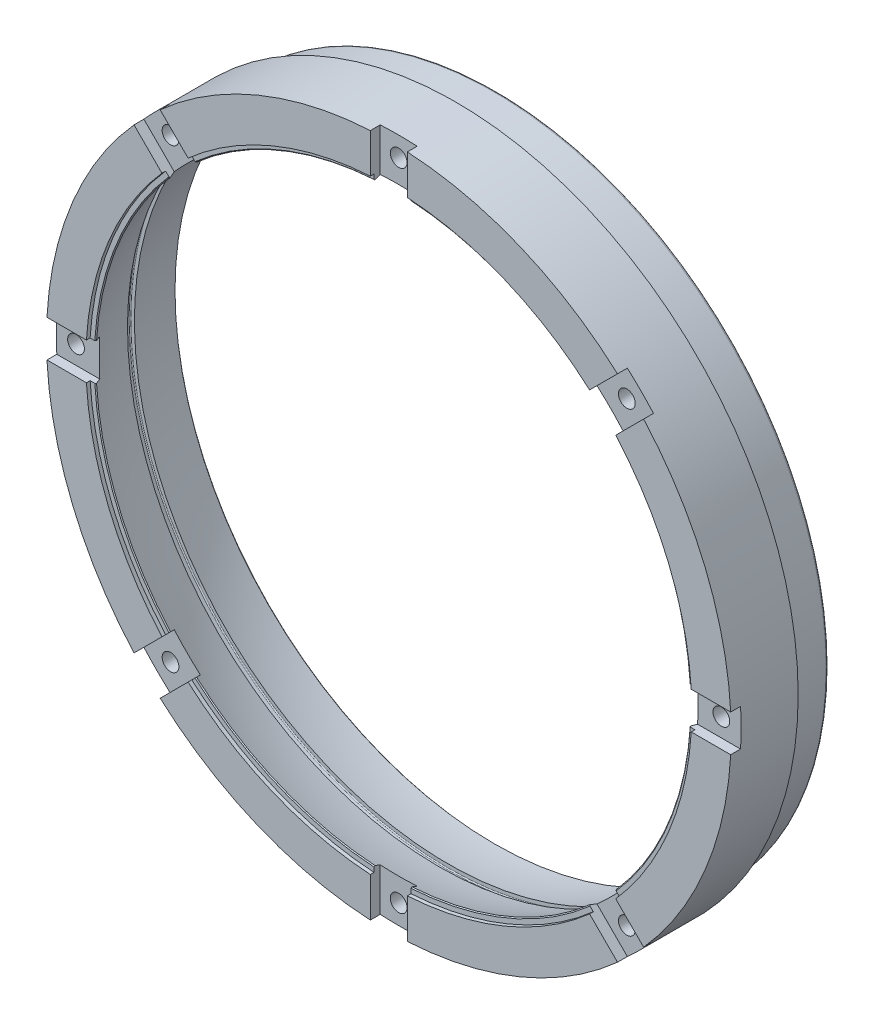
ISO-10303-21;
HEADER;
FILE_DESCRIPTION(('STEP AP214'),'2;1');
FILE_NAME('part.step','',(''),(''),'','','');
FILE_SCHEMA(('AUTOMOTIVE_DESIGN { 1 0 10303 214 1 1 1 1 }'));
ENDSEC;
DATA;
#1=APPLICATION_CONTEXT('core data for automotive mechanical design processes');
#2=APPLICATION_PROTOCOL_DEFINITION('international standard','automotive_design',2000,#1);
#3=PRODUCT_CONTEXT('',#1,'mechanical');
#4=PRODUCT('Part','Part','',(#3));
#5=PRODUCT_RELATED_PRODUCT_CATEGORY('part','',(#4));
#6=PRODUCT_DEFINITION_FORMATION('','',#4);
#7=PRODUCT_DEFINITION_CONTEXT('part definition',#1,'design');
#8=PRODUCT_DEFINITION('design','',#6,#7);
#9=PRODUCT_DEFINITION_SHAPE('','',#8);
#10=(LENGTH_UNIT() NAMED_UNIT(*) SI_UNIT(.MILLI.,.METRE.));
#11=(NAMED_UNIT(*) PLANE_ANGLE_UNIT() SI_UNIT($,.RADIAN.));
#12=(NAMED_UNIT(*) SI_UNIT($,.STERADIAN.) SOLID_ANGLE_UNIT());
#13=UNCERTAINTY_MEASURE_WITH_UNIT(LENGTH_MEASURE(1.E-05),#10,'distance_accuracy_value','');
#14=(GEOMETRIC_REPRESENTATION_CONTEXT(3) GLOBAL_UNCERTAINTY_ASSIGNED_CONTEXT((#13)) GLOBAL_UNIT_ASSIGNED_CONTEXT((#10,
#11,#12)) REPRESENTATION_CONTEXT('',''));
#15=CARTESIAN_POINT('',(0.,0.,0.));
#16=DIRECTION('',(0.,0.,1.));
#17=DIRECTION('',(1.,0.,0.));
#18=AXIS2_PLACEMENT_3D('',#15,#16,#17);
#19=CARTESIAN_POINT('',(0.,123.,0.));
#20=DIRECTION('',(0.,0.,-1.));
#21=DIRECTION('',(-1.,0.,0.));
#22=AXIS2_PLACEMENT_3D('',#19,#20,#21);
#23=PLANE('',#22);
#24=CARTESIAN_POINT('',(0.,0.,0.));
#25=DIRECTION('',(0.,0.,1.));
#26=DIRECTION('',(1.,0.,0.));
#27=AXIS2_PLACEMENT_3D('',#24,#25,#26);
#28=CIRCLE('',#27,139.);
#29=CARTESIAN_POINT('',(138.797514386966,7.50000000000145,0.));
#30=VERTEX_POINT('',#29);
#31=CARTESIAN_POINT('',(103.447964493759,92.8413627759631,0.));
#32=VERTEX_POINT('',#31);
#33=EDGE_CURVE('E1130',#30,#32,#28,.T.);
#34=ORIENTED_EDGE('',*,*,#33,.T.);
#35=DIRECTION('',(0.707106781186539,0.707106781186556,0.));
#36=VECTOR('',#35,1.);
#37=CARTESIAN_POINT('',(108.972343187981,98.3657414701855,0.));
#38=LINE('',#37,#36);
#39=CARTESIAN_POINT('',(92.1155983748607,81.5089966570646,0.));
#40=VERTEX_POINT('',#39);
#41=EDGE_CURVE('E472',#40,#32,#38,.T.);
#42=ORIENTED_EDGE('',*,*,#41,.F.);
#43=CARTESIAN_POINT('',(0.,0.,0.));
#44=DIRECTION('',(0.,0.,1.));
#45=DIRECTION('',(1.,0.,0.));
#46=AXIS2_PLACEMENT_3D('',#43,#44,#45);
#47=CIRCLE('',#46,123.);
#48=CARTESIAN_POINT('',(122.771128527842,7.50000000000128,0.));
#49=VERTEX_POINT('',#48);
#50=EDGE_CURVE('E1240',#49,#40,#47,.T.);
#51=ORIENTED_EDGE('',*,*,#50,.F.);
#52=DIRECTION('',(-1.,0.,0.));
#53=VECTOR('',#52,1.);
#54=CARTESIAN_POINT('',(146.61016566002,7.50000000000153,0.));
#55=LINE('',#54,#53);
#56=EDGE_CURVE('E510',#30,#49,#55,.T.);
#57=ORIENTED_EDGE('',*,*,#56,.F.);
#58=EDGE_LOOP('',(#34,#42,#51,#57));
#59=FACE_BOUND('',#58,.T.);
#60=ADVANCED_FACE('F38',(#59),#23,.F.);
#61=CARTESIAN_POINT('',(0.,0.,0.));
#62=DIRECTION('',(0.,0.,1.));
#63=DIRECTION('',(1.,0.,0.));
#64=AXIS2_PLACEMENT_3D('',#61,#62,#63);
#65=CYLINDRICAL_SURFACE('',#64,123.);
#66=ORIENTED_EDGE('',*,*,#50,.T.);
#67=DIRECTION('',(0.,0.,1.));
#68=VECTOR('',#67,1.);
#69=CARTESIAN_POINT('',(92.1155983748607,81.5089966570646,0.));
#70=LINE('',#69,#68);
#71=CARTESIAN_POINT('',(92.1155983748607,81.5089966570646,-1.5));
#72=VERTEX_POINT('',#71);
#73=EDGE_CURVE('E497',#40,#72,#70,.F.);
#74=ORIENTED_EDGE('',*,*,#73,.T.);
#75=CARTESIAN_POINT('',(0.,0.,-1.5));
#76=DIRECTION('',(0.,0.,1.));
#77=DIRECTION('',(1.,0.,0.));
#78=AXIS2_PLACEMENT_3D('',#75,#76,#77);
#79=CIRCLE('',#78,123.);
#80=CARTESIAN_POINT('',(122.771128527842,7.50000000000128,-1.5));
#81=VERTEX_POINT('',#80);
#82=EDGE_CURVE('E1212',#81,#72,#79,.T.);
#83=ORIENTED_EDGE('',*,*,#82,.F.);
#84=DIRECTION('',(0.,0.,1.));
#85=VECTOR('',#84,1.);
#86=CARTESIAN_POINT('',(122.771128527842,7.50000000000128,0.));
#87=LINE('',#86,#85);
#88=EDGE_CURVE('E520',#81,#49,#87,.T.);
#89=ORIENTED_EDGE('',*,*,#88,.T.);
#90=EDGE_LOOP('',(#66,#74,#83,#89));
#91=FACE_BOUND('',#90,.T.);
#92=ADVANCED_FACE('F866',(#91),#65,.F.);
#93=CARTESIAN_POINT('',(0.,120.614053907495,-1.5));
#94=DIRECTION('',(0.,0.,-1.));
#95=DIRECTION('',(-1.,0.,0.));
#96=AXIS2_PLACEMENT_3D('',#93,#94,#95);
#97=PLANE('',#96);
#98=ORIENTED_EDGE('',*,*,#82,.T.);
#99=DIRECTION('',(-0.707106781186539,-0.707106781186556,0.));
#100=VECTOR('',#99,1.);
#101=CARTESIAN_POINT('',(65.6103278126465,55.0037260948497,-1.5));
#102=LINE('',#101,#100);
#103=CARTESIAN_POINT('',(90.7795082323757,80.1729065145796,-1.5));
#104=VERTEX_POINT('',#103);
#105=EDGE_CURVE('E495',#72,#104,#102,.T.);
#106=ORIENTED_EDGE('',*,*,#105,.T.);
#107=CARTESIAN_POINT('',(0.,0.,-1.5));
#108=DIRECTION('',(0.,0.,-1.));
#109=DIRECTION('',(-1.,0.,0.));
#110=AXIS2_PLACEMENT_3D('',#107,#108,#109);
#111=CIRCLE('',#110,121.114053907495);
#112=CARTESIAN_POINT('',(120.881611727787,7.50000000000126,-1.5));
#113=VERTEX_POINT('',#112);
#114=EDGE_CURVE('E61',#104,#113,#111,.T.);
#115=ORIENTED_EDGE('',*,*,#114,.T.);
#116=DIRECTION('',(1.,0.,0.));
#117=VECTOR('',#116,1.);
#118=CARTESIAN_POINT('',(1.19983458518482E-12,7.49999999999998,-1.5));
#119=LINE('',#118,#117);
#120=EDGE_CURVE('E518',#113,#81,#119,.T.);
#121=ORIENTED_EDGE('',*,*,#120,.T.);
#122=EDGE_LOOP('',(#98,#106,#115,#121));
#123=FACE_BOUND('',#122,.T.);
#124=ADVANCED_FACE('F860',(#123),#97,.F.);
#125=CARTESIAN_POINT('',(0.,0.,-1.8570429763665));
#126=DIRECTION('',(0.,0.,1.));
#127=DIRECTION('',(1.,0.,0.));
#128=AXIS2_PLACEMENT_3D('',#125,#126,#127);
#129=CONICAL_SURFACE('',#128,120.757010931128,0.785398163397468);
#130=CARTESIAN_POINT('',(90.5264121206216,79.9198104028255,-1.85724297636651));
#131=CARTESIAN_POINT('',(90.56861854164,79.9620168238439,-1.79766931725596));
#132=CARTESIAN_POINT('',(90.6108249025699,80.0042231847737,-1.73809557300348));
#133=CARTESIAN_POINT('',(90.6952375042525,80.0886357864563,-1.61894791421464));
#134=CARTESIAN_POINT('',(90.7374437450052,80.1308420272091,-1.55937399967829));
#135=CARTESIAN_POINT('',(90.7796499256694,80.1730482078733,-1.4998));
#136=B_SPLINE_CURVE_WITH_KNOTS('',3,(#130,#131,#132,#133,#134,#135),.UNSPECIFIED.,.F.,.F.,(4,2,
4),(0.,0.252994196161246,0.505988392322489),.UNSPECIFIED.);
#137=CARTESIAN_POINT('',(90.5265538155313,79.9199520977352,-1.85704297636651));
#138=VERTEX_POINT('',#137);
#139=EDGE_CURVE('E1033',#138,#104,#136,.T.);
#140=ORIENTED_EDGE('',*,*,#139,.F.);
#141=CARTESIAN_POINT('',(0.,0.,-1.85704297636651));
#142=DIRECTION('',(0.,0.,-1.));
#143=DIRECTION('',(-1.,0.,0.));
#144=AXIS2_PLACEMENT_3D('',#141,#142,#143);
#145=CIRCLE('',#144,120.757010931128);
#146=CARTESIAN_POINT('',(120.523880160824,7.50000000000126,-1.85704297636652));
#147=VERTEX_POINT('',#146);
#148=EDGE_CURVE('E1206',#147,#138,#145,.F.);
#149=ORIENTED_EDGE('',*,*,#148,.F.);
#150=CARTESIAN_POINT('',(137.495885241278,7.50000000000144,15.0862309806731));
#151=CARTESIAN_POINT('',(134.588928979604,7.50000000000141,12.1835952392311));
#152=CARTESIAN_POINT('',(131.681841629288,7.50000000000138,9.28109076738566));
#153=CARTESIAN_POINT('',(125.867333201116,7.50000000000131,3.4764162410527));
#154=CARTESIAN_POINT('',(122.959912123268,7.50000000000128,0.57424618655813));
#155=CARTESIAN_POINT('',(117.144664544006,7.50000000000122,-5.22968777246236));
#156=CARTESIAN_POINT('',(114.236838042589,7.50000000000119,-8.13145167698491));
#157=CARTESIAN_POINT('',(108.420668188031,7.50000000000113,-13.9344615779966));
#158=CARTESIAN_POINT('',(105.51232483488,7.5000000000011,-16.8357075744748));
#159=CARTESIAN_POINT('',(102.603667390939,7.50000000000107,-19.7366386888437));
#160=B_SPLINE_CURVE_WITH_KNOTS('',3,(#150,#151,#152,#153,#154,#155,#156,#157,#158,#159),
.UNSPECIFIED.,.F.,.F.,(4,2,2,2,4),(0.,12.324009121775,24.6480179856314,36.9720269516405,
49.2960361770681),.UNSPECIFIED.);
#161=EDGE_CURVE('E1076',#113,#147,#160,.T.);
#162=ORIENTED_EDGE('',*,*,#161,.F.);
#163=ORIENTED_EDGE('',*,*,#114,.F.);
#164=EDGE_LOOP('',(#140,#149,#162,#163));
#165=FACE_BOUND('',#164,.T.);
#166=ADVANCED_FACE('F892',(#165),#129,.F.);
#167=CARTESIAN_POINT('',(103.447964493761,-92.841362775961,0.));
#168=VERTEX_POINT('',#167);
#169=CARTESIAN_POINT('',(138.797514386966,-7.49999999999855,0.));
#170=VERTEX_POINT('',#169);
#171=EDGE_CURVE('E1131',#168,#170,#28,.T.);
#172=ORIENTED_EDGE('',*,*,#171,.T.);
#173=DIRECTION('',(1.,0.,0.));
#174=VECTOR('',#173,1.);
#175=CARTESIAN_POINT('',(146.61016566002,-7.49999999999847,0.));
#176=LINE('',#175,#174);
#177=CARTESIAN_POINT('',(122.771128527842,-7.49999999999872,0.));
#178=VERTEX_POINT('',#177);
#179=EDGE_CURVE('E505',#178,#170,#176,.T.);
#180=ORIENTED_EDGE('',*,*,#179,.F.);
#181=CARTESIAN_POINT('',(92.1155983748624,-81.5089966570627,0.));
#182=VERTEX_POINT('',#181);
#183=EDGE_CURVE('E1237',#182,#178,#47,.T.);
#184=ORIENTED_EDGE('',*,*,#183,.F.);
#185=DIRECTION('',(-0.707106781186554,0.707106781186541,0.));
#186=VECTOR('',#185,1.);
#187=CARTESIAN_POINT('',(108.972343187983,-98.3657414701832,0.));
#188=LINE('',#187,#186);
#189=EDGE_CURVE('E545',#168,#182,#188,.T.);
#190=ORIENTED_EDGE('',*,*,#189,.F.);
#191=EDGE_LOOP('',(#172,#180,#184,#190));
#192=FACE_BOUND('',#191,.T.);
#193=ADVANCED_FACE('F884',(#192),#23,.F.);
#194=ORIENTED_EDGE('',*,*,#183,.T.);
#195=DIRECTION('',(0.,0.,1.));
#196=VECTOR('',#195,1.);
#197=CARTESIAN_POINT('',(122.771128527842,-7.49999999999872,0.));
#198=LINE('',#197,#196);
#199=CARTESIAN_POINT('',(122.771128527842,-7.49999999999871,-1.5));
#200=VERTEX_POINT('',#199);
#201=EDGE_CURVE('E532',#178,#200,#198,.F.);
#202=ORIENTED_EDGE('',*,*,#201,.T.);
#203=CARTESIAN_POINT('',(92.1155983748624,-81.5089966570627,-1.5));
#204=VERTEX_POINT('',#203);
#205=EDGE_CURVE('E1097',#204,#200,#79,.T.);
#206=ORIENTED_EDGE('',*,*,#205,.F.);
#207=DIRECTION('',(0.,0.,1.));
#208=VECTOR('',#207,1.);
#209=CARTESIAN_POINT('',(92.1155983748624,-81.5089966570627,0.));
#210=LINE('',#209,#208);
#211=EDGE_CURVE('E556',#204,#182,#210,.T.);
#212=ORIENTED_EDGE('',*,*,#211,.T.);
#213=EDGE_LOOP('',(#194,#202,#206,#212));
#214=FACE_BOUND('',#213,.T.);
#215=ADVANCED_FACE('F889',(#214),#65,.F.);
#216=ORIENTED_EDGE('',*,*,#205,.T.);
#217=DIRECTION('',(-1.,0.,0.));
#218=VECTOR('',#217,1.);
#219=CARTESIAN_POINT('',(1.35327080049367E-12,-7.50000000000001,-1.5));
#220=LINE('',#219,#218);
#221=CARTESIAN_POINT('',(120.881611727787,-7.49999999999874,-1.5));
#222=VERTEX_POINT('',#221);
#223=EDGE_CURVE('E529',#200,#222,#220,.T.);
#224=ORIENTED_EDGE('',*,*,#223,.T.);
#225=CARTESIAN_POINT('',(90.7795082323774,-80.1729065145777,-1.5));
#226=VERTEX_POINT('',#225);
#227=EDGE_CURVE('E1094',#222,#226,#111,.T.);
#228=ORIENTED_EDGE('',*,*,#227,.T.);
#229=DIRECTION('',(0.707106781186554,-0.707106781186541,0.));
#230=VECTOR('',#229,1.);
#231=CARTESIAN_POINT('',(-55.0037260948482,65.6103278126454,-1.5));
#232=LINE('',#231,#230);
#233=EDGE_CURVE('E553',#226,#204,#232,.T.);
#234=ORIENTED_EDGE('',*,*,#233,.T.);
#235=EDGE_LOOP('',(#216,#224,#228,#234));
#236=FACE_BOUND('',#235,.T.);
#237=ADVANCED_FACE('F899',(#236),#97,.F.);
#238=CARTESIAN_POINT('',(102.60366739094,-7.49999999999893,-19.7366386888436));
#239=CARTESIAN_POINT('',(105.51232483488,-7.4999999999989,-16.8357075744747));
#240=CARTESIAN_POINT('',(108.420668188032,-7.49999999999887,-13.9344615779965));
#241=CARTESIAN_POINT('',(114.236838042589,-7.49999999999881,-8.13145167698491));
#242=CARTESIAN_POINT('',(117.144664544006,-7.49999999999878,-5.22968777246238));
#243=CARTESIAN_POINT('',(122.959912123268,-7.49999999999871,0.574246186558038));
#244=CARTESIAN_POINT('',(125.867333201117,-7.49999999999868,3.47641624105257));
#245=CARTESIAN_POINT('',(131.681841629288,-7.49999999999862,9.28109076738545));
#246=CARTESIAN_POINT('',(134.588928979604,-7.49999999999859,12.1835952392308));
#247=CARTESIAN_POINT('',(137.495885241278,-7.49999999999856,15.0862309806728));
#248=B_SPLINE_CURVE_WITH_KNOTS('',3,(#238,#239,#240,#241,#242,#243,#244,#245,#246,#247),
.UNSPECIFIED.,.F.,.F.,(4,2,2,2,4),(0.,12.3240092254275,24.6480181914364,36.9720270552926,
49.2960361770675),.UNSPECIFIED.);
#249=CARTESIAN_POINT('',(120.523880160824,-7.49999999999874,-1.85704297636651));
#250=VERTEX_POINT('',#249);
#251=EDGE_CURVE('E1038',#250,#222,#248,.T.);
#252=ORIENTED_EDGE('',*,*,#251,.F.);
#253=CARTESIAN_POINT('',(90.526553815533,-79.9199520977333,-1.85704297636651));
#254=VERTEX_POINT('',#253);
#255=EDGE_CURVE('E1204',#254,#250,#145,.F.);
#256=ORIENTED_EDGE('',*,*,#255,.F.);
#257=CARTESIAN_POINT('',(90.7796499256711,-80.1730482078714,-1.49980000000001));
#258=CARTESIAN_POINT('',(90.7374437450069,-80.1308420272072,-1.55937399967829));
#259=CARTESIAN_POINT('',(90.6952375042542,-80.0886357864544,-1.61894791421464));
#260=CARTESIAN_POINT('',(90.6108249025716,-80.0042231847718,-1.73809557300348));
#261=CARTESIAN_POINT('',(90.5686185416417,-79.962016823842,-1.79766931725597));
#262=CARTESIAN_POINT('',(90.5264121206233,-79.9198104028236,-1.85724297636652));
#263=B_SPLINE_CURVE_WITH_KNOTS('',3,(#257,#258,#259,#260,#261,#262),.UNSPECIFIED.,.F.,.F.,(4,2,
4),(0.,0.25299419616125,0.505988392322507),.UNSPECIFIED.);
#264=EDGE_CURVE('E1099',#226,#254,#263,.T.);
#265=ORIENTED_EDGE('',*,*,#264,.F.);
#266=ORIENTED_EDGE('',*,*,#227,.F.);
#267=EDGE_LOOP('',(#252,#256,#265,#266));
#268=FACE_BOUND('',#267,.T.);
#269=ADVANCED_FACE('F903',(#268),#129,.F.);
#270=CARTESIAN_POINT('',(7.50000000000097,-138.797514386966,0.));
#271=VERTEX_POINT('',#270);
#272=CARTESIAN_POINT('',(92.8413627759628,-103.447964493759,0.));
#273=VERTEX_POINT('',#272);
#274=EDGE_CURVE('E1135',#271,#273,#28,.T.);
#275=ORIENTED_EDGE('',*,*,#274,.T.);
#276=DIRECTION('',(0.707106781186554,-0.707106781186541,0.));
#277=VECTOR('',#276,1.);
#278=CARTESIAN_POINT('',(98.3657414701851,-108.972343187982,0.));
#279=LINE('',#278,#277);
#280=CARTESIAN_POINT('',(81.5089966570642,-92.115598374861,0.));
#281=VERTEX_POINT('',#280);
#282=EDGE_CURVE('E540',#281,#273,#279,.T.);
#283=ORIENTED_EDGE('',*,*,#282,.F.);
#284=CARTESIAN_POINT('',(7.50000000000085,-122.771128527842,0.));
#285=VERTEX_POINT('',#284);
#286=EDGE_CURVE('E1234',#285,#281,#47,.T.);
#287=ORIENTED_EDGE('',*,*,#286,.F.);
#288=DIRECTION('',(0.,1.,0.));
#289=VECTOR('',#288,1.);
#290=CARTESIAN_POINT('',(7.50000000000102,-146.61016566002,0.));
#291=LINE('',#290,#289);
#292=EDGE_CURVE('E581',#271,#285,#291,.T.);
#293=ORIENTED_EDGE('',*,*,#292,.F.);
#294=EDGE_LOOP('',(#275,#283,#287,#293));
#295=FACE_BOUND('',#294,.T.);
#296=ADVANCED_FACE('F894',(#295),#23,.F.);
#297=ORIENTED_EDGE('',*,*,#286,.T.);
#298=DIRECTION('',(0.,0.,1.));
#299=VECTOR('',#298,1.);
#300=CARTESIAN_POINT('',(81.5089966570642,-92.115598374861,0.));
#301=LINE('',#300,#299);
#302=CARTESIAN_POINT('',(81.5089966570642,-92.115598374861,-1.5));
#303=VERTEX_POINT('',#302);
#304=EDGE_CURVE('E568',#281,#303,#301,.F.);
#305=ORIENTED_EDGE('',*,*,#304,.T.);
#306=CARTESIAN_POINT('',(7.50000000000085,-122.771128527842,-1.5));
#307=VERTEX_POINT('',#306);
#308=EDGE_CURVE('E1215',#307,#303,#79,.T.);
#309=ORIENTED_EDGE('',*,*,#308,.F.);
#310=DIRECTION('',(0.,0.,1.));
#311=VECTOR('',#310,1.);
#312=CARTESIAN_POINT('',(7.50000000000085,-122.771128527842,0.));
#313=LINE('',#312,#311);
#314=EDGE_CURVE('E592',#307,#285,#313,.T.);
#315=ORIENTED_EDGE('',*,*,#314,.T.);
#316=EDGE_LOOP('',(#297,#305,#309,#315));
#317=FACE_BOUND('',#316,.T.);
#318=ADVANCED_FACE('F901',(#317),#65,.F.);
#319=ORIENTED_EDGE('',*,*,#308,.T.);
#320=DIRECTION('',(-0.707106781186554,0.707106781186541,0.));
#321=VECTOR('',#320,1.);
#322=CARTESIAN_POINT('',(-65.6103278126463,55.003726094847,-1.5));
#323=LINE('',#322,#321);
#324=CARTESIAN_POINT('',(80.1729065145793,-90.779508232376,-1.50000000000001));
#325=VERTEX_POINT('',#324);
#326=EDGE_CURVE('E565',#303,#325,#323,.T.);
#327=ORIENTED_EDGE('',*,*,#326,.T.);
#328=CARTESIAN_POINT('',(7.50000000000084,-120.881611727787,-1.5));
#329=VERTEX_POINT('',#328);
#330=EDGE_CURVE('E1100',#325,#329,#111,.T.);
#331=ORIENTED_EDGE('',*,*,#330,.T.);
#332=DIRECTION('',(0.,-1.,0.));
#333=VECTOR('',#332,1.);
#334=CARTESIAN_POINT('',(7.49999999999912,120.614053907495,-1.5));
#335=LINE('',#334,#333);
#336=EDGE_CURVE('E589',#329,#307,#335,.T.);
#337=ORIENTED_EDGE('',*,*,#336,.T.);
#338=EDGE_LOOP('',(#319,#327,#331,#337));
#339=FACE_BOUND('',#338,.T.);
#340=ADVANCED_FACE('F912',(#339),#97,.F.);
#341=CARTESIAN_POINT('',(79.9198104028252,-90.5264121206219,-1.85724297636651));
#342=CARTESIAN_POINT('',(79.9620168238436,-90.5686185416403,-1.79766931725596));
#343=CARTESIAN_POINT('',(80.0042231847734,-90.6108249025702,-1.73809557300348));
#344=CARTESIAN_POINT('',(80.088635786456,-90.6952375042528,-1.61894791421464));
#345=CARTESIAN_POINT('',(80.1308420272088,-90.7374437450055,-1.55937399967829));
#346=CARTESIAN_POINT('',(80.173048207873,-90.7796499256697,-1.4998));
#347=B_SPLINE_CURVE_WITH_KNOTS('',3,(#341,#342,#343,#344,#345,#346),.UNSPECIFIED.,.F.,.F.,(4,2,
4),(0.,0.252994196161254,0.505988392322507),.UNSPECIFIED.);
#348=CARTESIAN_POINT('',(79.9199520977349,-90.5265538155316,-1.85704297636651));
#349=VERTEX_POINT('',#348);
#350=EDGE_CURVE('E1257',#349,#325,#347,.T.);
#351=ORIENTED_EDGE('',*,*,#350,.F.);
#352=CARTESIAN_POINT('',(7.50000000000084,-120.523880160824,-1.85704297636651));
#353=VERTEX_POINT('',#352);
#354=EDGE_CURVE('E1201',#353,#349,#145,.F.);
#355=ORIENTED_EDGE('',*,*,#354,.F.);
#356=CARTESIAN_POINT('',(7.50000000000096,-137.495885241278,15.086230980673));
#357=CARTESIAN_POINT('',(7.50000000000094,-134.588928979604,12.183595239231));
#358=CARTESIAN_POINT('',(7.50000000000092,-131.681841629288,9.28109076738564));
#359=CARTESIAN_POINT('',(7.50000000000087,-125.867333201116,3.47641624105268));
#360=CARTESIAN_POINT('',(7.50000000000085,-122.959912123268,0.574246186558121));
#361=CARTESIAN_POINT('',(7.50000000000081,-117.144664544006,-5.22968777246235));
#362=CARTESIAN_POINT('',(7.50000000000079,-114.236838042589,-8.1314516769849));
#363=CARTESIAN_POINT('',(7.50000000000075,-108.420668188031,-13.9344615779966));
#364=CARTESIAN_POINT('',(7.50000000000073,-105.51232483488,-16.8357075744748));
#365=CARTESIAN_POINT('',(7.50000000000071,-102.60366739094,-19.7366386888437));
#366=B_SPLINE_CURVE_WITH_KNOTS('',3,(#356,#357,#358,#359,#360,#361,#362,#363,#364,#365),
.UNSPECIFIED.,.F.,.F.,(4,2,2,2,4),(0.,12.324009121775,24.6480179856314,36.9720269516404,
49.296036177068),.UNSPECIFIED.);
#367=EDGE_CURVE('E1286',#329,#353,#366,.T.);
#368=ORIENTED_EDGE('',*,*,#367,.F.);
#369=ORIENTED_EDGE('',*,*,#330,.F.);
#370=EDGE_LOOP('',(#351,#355,#368,#369));
#371=FACE_BOUND('',#370,.T.);
#372=ADVANCED_FACE('F916',(#371),#129,.F.);
#373=CARTESIAN_POINT('',(-92.8413627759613,-103.447964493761,0.));
#374=VERTEX_POINT('',#373);
#375=CARTESIAN_POINT('',(-7.49999999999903,-138.797514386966,0.));
#376=VERTEX_POINT('',#375);
#377=EDGE_CURVE('E1139',#374,#376,#28,.T.);
#378=ORIENTED_EDGE('',*,*,#377,.T.);
#379=DIRECTION('',(0.,-1.,0.));
#380=VECTOR('',#379,1.);
#381=CARTESIAN_POINT('',(-7.49999999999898,-146.61016566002,0.));
#382=LINE('',#381,#380);
#383=CARTESIAN_POINT('',(-7.49999999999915,-122.771128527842,0.));
#384=VERTEX_POINT('',#383);
#385=EDGE_CURVE('E576',#384,#376,#382,.T.);
#386=ORIENTED_EDGE('',*,*,#385,.F.);
#387=CARTESIAN_POINT('',(-81.508996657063,-92.1155983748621,0.));
#388=VERTEX_POINT('',#387);
#389=EDGE_CURVE('E1231',#388,#384,#47,.T.);
#390=ORIENTED_EDGE('',*,*,#389,.F.);
#391=DIRECTION('',(0.707106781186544,0.707106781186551,0.));
#392=VECTOR('',#391,1.);
#393=CARTESIAN_POINT('',(-98.3657414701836,-108.972343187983,0.));
#394=LINE('',#393,#392);
#395=EDGE_CURVE('E617',#374,#388,#394,.T.);
#396=ORIENTED_EDGE('',*,*,#395,.F.);
#397=EDGE_LOOP('',(#378,#386,#390,#396));
#398=FACE_BOUND('',#397,.T.);
#399=ADVANCED_FACE('F907',(#398),#23,.F.);
#400=ORIENTED_EDGE('',*,*,#389,.T.);
#401=DIRECTION('',(0.,0.,1.));
#402=VECTOR('',#401,1.);
#403=CARTESIAN_POINT('',(-7.49999999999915,-122.771128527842,0.));
#404=LINE('',#403,#402);
#405=CARTESIAN_POINT('',(-7.49999999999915,-122.771128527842,-1.5));
#406=VERTEX_POINT('',#405);
#407=EDGE_CURVE('E604',#384,#406,#404,.F.);
#408=ORIENTED_EDGE('',*,*,#407,.T.);
#409=CARTESIAN_POINT('',(-81.508996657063,-92.1155983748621,-1.5));
#410=VERTEX_POINT('',#409);
#411=EDGE_CURVE('E1217',#410,#406,#79,.T.);
#412=ORIENTED_EDGE('',*,*,#411,.F.);
#413=DIRECTION('',(0.,0.,1.));
#414=VECTOR('',#413,1.);
#415=CARTESIAN_POINT('',(-81.508996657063,-92.1155983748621,0.));
#416=LINE('',#415,#414);
#417=EDGE_CURVE('E628',#410,#388,#416,.T.);
#418=ORIENTED_EDGE('',*,*,#417,.T.);
#419=EDGE_LOOP('',(#400,#408,#412,#418));
#420=FACE_BOUND('',#419,.T.);
#421=ADVANCED_FACE('F914',(#420),#65,.F.);
#422=ORIENTED_EDGE('',*,*,#411,.T.);
#423=DIRECTION('',(0.,1.,0.));
#424=VECTOR('',#423,1.);
#425=CARTESIAN_POINT('',(-7.50000000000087,120.614053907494,-1.5));
#426=LINE('',#425,#424);
#427=CARTESIAN_POINT('',(-7.49999999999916,-120.881611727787,-1.5));
#428=VERTEX_POINT('',#427);
#429=EDGE_CURVE('E601',#406,#428,#426,.T.);
#430=ORIENTED_EDGE('',*,*,#429,.T.);
#431=CARTESIAN_POINT('',(-80.172906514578,-90.7795082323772,-1.5));
#432=VERTEX_POINT('',#431);
#433=EDGE_CURVE('E1101',#428,#432,#111,.T.);
#434=ORIENTED_EDGE('',*,*,#433,.T.);
#435=DIRECTION('',(-0.707106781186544,-0.707106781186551,0.));
#436=VECTOR('',#435,1.);
#437=CARTESIAN_POINT('',(65.6103278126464,55.0037260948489,-1.5));
#438=LINE('',#437,#436);
#439=EDGE_CURVE('E625',#432,#410,#438,.T.);
#440=ORIENTED_EDGE('',*,*,#439,.T.);
#441=EDGE_LOOP('',(#422,#430,#434,#440));
#442=FACE_BOUND('',#441,.T.);
#443=ADVANCED_FACE('F925',(#442),#97,.F.);
#444=CARTESIAN_POINT('',(-7.49999999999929,-102.60366739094,-19.7366386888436));
#445=CARTESIAN_POINT('',(-7.49999999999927,-105.51232483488,-16.8357075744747));
#446=CARTESIAN_POINT('',(-7.49999999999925,-108.420668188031,-13.9344615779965));
#447=CARTESIAN_POINT('',(-7.49999999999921,-114.236838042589,-8.1314516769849));
#448=CARTESIAN_POINT('',(-7.49999999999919,-117.144664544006,-5.22968777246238));
#449=CARTESIAN_POINT('',(-7.49999999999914,-122.959912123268,0.574246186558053));
#450=CARTESIAN_POINT('',(-7.49999999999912,-125.867333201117,3.47641624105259));
#451=CARTESIAN_POINT('',(-7.49999999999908,-131.681841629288,9.2810907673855));
#452=CARTESIAN_POINT('',(-7.49999999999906,-134.588928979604,12.1835952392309));
#453=CARTESIAN_POINT('',(-7.49999999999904,-137.495885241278,15.0862309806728));
#454=B_SPLINE_CURVE_WITH_KNOTS('',3,(#444,#445,#446,#447,#448,#449,#450,#451,#452,#453),
.UNSPECIFIED.,.F.,.F.,(4,2,2,2,4),(0.,12.3240092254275,24.6480181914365,36.9720270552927,
49.2960361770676),.UNSPECIFIED.);
#455=CARTESIAN_POINT('',(-7.49999999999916,-120.523880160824,-1.85704297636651));
#456=VERTEX_POINT('',#455);
#457=EDGE_CURVE('E1291',#456,#428,#454,.T.);
#458=ORIENTED_EDGE('',*,*,#457,.F.);
#459=CARTESIAN_POINT('',(-79.9199520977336,-90.5265538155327,-1.85704297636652));
#460=VERTEX_POINT('',#459);
#461=EDGE_CURVE('E1198',#460,#456,#145,.F.);
#462=ORIENTED_EDGE('',*,*,#461,.F.);
#463=CARTESIAN_POINT('',(-80.1730482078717,-90.7796499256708,-1.49980000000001));
#464=CARTESIAN_POINT('',(-80.1308420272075,-90.7374437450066,-1.5593739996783));
#465=CARTESIAN_POINT('',(-80.0886357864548,-90.6952375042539,-1.61894791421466));
#466=CARTESIAN_POINT('',(-80.0042231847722,-90.6108249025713,-1.73809557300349));
#467=CARTESIAN_POINT('',(-79.9620168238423,-90.5686185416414,-1.79766931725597));
#468=CARTESIAN_POINT('',(-79.9198104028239,-90.526412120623,-1.85724297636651));
#469=B_SPLINE_CURVE_WITH_KNOTS('',3,(#463,#464,#465,#466,#467,#468),.UNSPECIFIED.,.F.,.F.,(4,2,
4),(0.,0.252994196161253,0.505988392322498),.UNSPECIFIED.);
#470=EDGE_CURVE('E1161',#432,#460,#469,.T.);
#471=ORIENTED_EDGE('',*,*,#470,.F.);
#472=ORIENTED_EDGE('',*,*,#433,.F.);
#473=EDGE_LOOP('',(#458,#462,#471,#472));
#474=FACE_BOUND('',#473,.T.);
#475=ADVANCED_FACE('F929',(#474),#129,.F.);
#476=CARTESIAN_POINT('',(-138.797514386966,-7.50000000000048,0.));
#477=VERTEX_POINT('',#476);
#478=CARTESIAN_POINT('',(-103.44796449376,-92.8413627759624,0.));
#479=VERTEX_POINT('',#478);
#480=EDGE_CURVE('E1143',#477,#479,#28,.T.);
#481=ORIENTED_EDGE('',*,*,#480,.T.);
#482=DIRECTION('',(-0.707106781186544,-0.707106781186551,0.));
#483=VECTOR('',#482,1.);
#484=CARTESIAN_POINT('',(-108.972343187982,-98.3657414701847,0.));
#485=LINE('',#484,#483);
#486=CARTESIAN_POINT('',(-92.1155983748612,-81.5089966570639,0.));
#487=VERTEX_POINT('',#486);
#488=EDGE_CURVE('E612',#487,#479,#485,.T.);
#489=ORIENTED_EDGE('',*,*,#488,.F.);
#490=CARTESIAN_POINT('',(-122.771128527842,-7.50000000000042,0.));
#491=VERTEX_POINT('',#490);
#492=EDGE_CURVE('E1229',#491,#487,#47,.T.);
#493=ORIENTED_EDGE('',*,*,#492,.F.);
#494=DIRECTION('',(1.,0.,0.));
#495=VECTOR('',#494,1.);
#496=CARTESIAN_POINT('',(-146.61016566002,-7.50000000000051,0.));
#497=LINE('',#496,#495);
#498=EDGE_CURVE('E653',#477,#491,#497,.T.);
#499=ORIENTED_EDGE('',*,*,#498,.F.);
#500=EDGE_LOOP('',(#481,#489,#493,#499));
#501=FACE_BOUND('',#500,.T.);
#502=ADVANCED_FACE('F920',(#501),#23,.F.);
#503=ORIENTED_EDGE('',*,*,#492,.T.);
#504=DIRECTION('',(0.,0.,1.));
#505=VECTOR('',#504,1.);
#506=CARTESIAN_POINT('',(-92.1155983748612,-81.5089966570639,0.));
#507=LINE('',#506,#505);
#508=CARTESIAN_POINT('',(-92.1155983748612,-81.5089966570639,-1.5));
#509=VERTEX_POINT('',#508);
#510=EDGE_CURVE('E640',#487,#509,#507,.F.);
#511=ORIENTED_EDGE('',*,*,#510,.T.);
#512=CARTESIAN_POINT('',(-122.771128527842,-7.50000000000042,-1.5));
#513=VERTEX_POINT('',#512);
#514=EDGE_CURVE('E1220',#513,#509,#79,.T.);
#515=ORIENTED_EDGE('',*,*,#514,.F.);
#516=DIRECTION('',(0.,0.,1.));
#517=VECTOR('',#516,1.);
#518=CARTESIAN_POINT('',(-122.771128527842,-7.50000000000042,0.));
#519=LINE('',#518,#517);
#520=EDGE_CURVE('E664',#513,#491,#519,.T.);
#521=ORIENTED_EDGE('',*,*,#520,.T.);
#522=EDGE_LOOP('',(#503,#511,#515,#521));
#523=FACE_BOUND('',#522,.T.);
#524=ADVANCED_FACE('F927',(#523),#65,.F.);
#525=ORIENTED_EDGE('',*,*,#514,.T.);
#526=DIRECTION('',(0.707106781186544,0.707106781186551,0.));
#527=VECTOR('',#526,1.);
#528=CARTESIAN_POINT('',(55.0037260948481,65.610327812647,-1.5));
#529=LINE('',#528,#527);
#530=CARTESIAN_POINT('',(-90.7795082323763,-80.172906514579,-1.5));
#531=VERTEX_POINT('',#530);
#532=EDGE_CURVE('E637',#509,#531,#529,.T.);
#533=ORIENTED_EDGE('',*,*,#532,.T.);
#534=CARTESIAN_POINT('',(-120.881611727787,-7.50000000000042,-1.5));
#535=VERTEX_POINT('',#534);
#536=EDGE_CURVE('E1105',#531,#535,#111,.T.);
#537=ORIENTED_EDGE('',*,*,#536,.T.);
#538=DIRECTION('',(-1.,0.,0.));
#539=VECTOR('',#538,1.);
#540=CARTESIAN_POINT('',(4.64327894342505E-13,-7.49999999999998,-1.5));
#541=LINE('',#540,#539);
#542=EDGE_CURVE('E661',#535,#513,#541,.T.);
#543=ORIENTED_EDGE('',*,*,#542,.T.);
#544=EDGE_LOOP('',(#525,#533,#537,#543));
#545=FACE_BOUND('',#544,.T.);
#546=ADVANCED_FACE('F938',(#545),#97,.F.);
#547=CARTESIAN_POINT('',(-90.5264121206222,-79.9198104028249,-1.85724297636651));
#548=CARTESIAN_POINT('',(-90.5686185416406,-79.9620168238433,-1.79766931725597));
#549=CARTESIAN_POINT('',(-90.6108249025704,-80.0042231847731,-1.73809557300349));
#550=CARTESIAN_POINT('',(-90.695237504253,-80.0886357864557,-1.61894791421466));
#551=CARTESIAN_POINT('',(-90.7374437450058,-80.1308420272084,-1.5593739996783));
#552=CARTESIAN_POINT('',(-90.77964992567,-80.1730482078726,-1.49980000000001));
#553=B_SPLINE_CURVE_WITH_KNOTS('',3,(#547,#548,#549,#550,#551,#552),.UNSPECIFIED.,.F.,.F.,(4,2,
4),(0.,0.252994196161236,0.505988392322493),.UNSPECIFIED.);
#554=CARTESIAN_POINT('',(-90.5265538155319,-79.9199520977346,-1.85704297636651));
#555=VERTEX_POINT('',#554);
#556=EDGE_CURVE('E1162',#555,#531,#553,.T.);
#557=ORIENTED_EDGE('',*,*,#556,.F.);
#558=CARTESIAN_POINT('',(-120.523880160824,-7.50000000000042,-1.85704297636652));
#559=VERTEX_POINT('',#558);
#560=EDGE_CURVE('E1196',#559,#555,#145,.F.);
#561=ORIENTED_EDGE('',*,*,#560,.F.);
#562=CARTESIAN_POINT('',(-137.495885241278,-7.50000000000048,15.086230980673));
#563=CARTESIAN_POINT('',(-134.588928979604,-7.50000000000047,12.183595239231));
#564=CARTESIAN_POINT('',(-131.681841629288,-7.50000000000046,9.2810907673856));
#565=CARTESIAN_POINT('',(-125.867333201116,-7.50000000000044,3.47641624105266));
#566=CARTESIAN_POINT('',(-122.959912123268,-7.50000000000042,0.574246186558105));
#567=CARTESIAN_POINT('',(-117.144664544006,-7.5000000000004,-5.22968777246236));
#568=CARTESIAN_POINT('',(-114.236838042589,-7.50000000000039,-8.13145167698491));
#569=CARTESIAN_POINT('',(-108.420668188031,-7.50000000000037,-13.9344615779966));
#570=CARTESIAN_POINT('',(-105.51232483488,-7.50000000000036,-16.8357075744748));
#571=CARTESIAN_POINT('',(-102.60366739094,-7.50000000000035,-19.7366386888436));
#572=B_SPLINE_CURVE_WITH_KNOTS('',3,(#562,#563,#564,#565,#566,#567,#568,#569,#570,#571),
.UNSPECIFIED.,.F.,.F.,(4,2,2,2,4),(0.,12.324009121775,24.6480179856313,36.9720269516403,
49.2960361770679),.UNSPECIFIED.);
#573=EDGE_CURVE('E975',#535,#559,#572,.T.);
#574=ORIENTED_EDGE('',*,*,#573,.F.);
#575=ORIENTED_EDGE('',*,*,#536,.F.);
#576=EDGE_LOOP('',(#557,#561,#574,#575));
#577=FACE_BOUND('',#576,.T.);
#578=ADVANCED_FACE('F942',(#577),#129,.F.);
#579=CARTESIAN_POINT('',(-103.44796449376,92.8413627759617,0.));
#580=VERTEX_POINT('',#579);
#581=CARTESIAN_POINT('',(-138.797514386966,7.49999999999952,0.));
#582=VERTEX_POINT('',#581);
#583=EDGE_CURVE('E784',#580,#582,#28,.T.);
#584=ORIENTED_EDGE('',*,*,#583,.T.);
#585=DIRECTION('',(-1.,0.,0.));
#586=VECTOR('',#585,1.);
#587=CARTESIAN_POINT('',(-146.61016566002,7.49999999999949,0.));
#588=LINE('',#587,#586);
#589=CARTESIAN_POINT('',(-122.771128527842,7.49999999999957,0.));
#590=VERTEX_POINT('',#589);
#591=EDGE_CURVE('E648',#590,#582,#588,.T.);
#592=ORIENTED_EDGE('',*,*,#591,.F.);
#593=CARTESIAN_POINT('',(-92.1155983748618,81.5089966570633,0.));
#594=VERTEX_POINT('',#593);
#595=EDGE_CURVE('E779',#594,#590,#47,.T.);
#596=ORIENTED_EDGE('',*,*,#595,.F.);
#597=DIRECTION('',(0.707106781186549,-0.707106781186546,0.));
#598=VECTOR('',#597,1.);
#599=CARTESIAN_POINT('',(-108.972343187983,98.3657414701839,0.));
#600=LINE('',#599,#598);
#601=EDGE_CURVE('E689',#580,#594,#600,.T.);
#602=ORIENTED_EDGE('',*,*,#601,.F.);
#603=EDGE_LOOP('',(#584,#592,#596,#602));
#604=FACE_BOUND('',#603,.T.);
#605=ADVANCED_FACE('F933',(#604),#23,.F.);
#606=ORIENTED_EDGE('',*,*,#595,.T.);
#607=DIRECTION('',(0.,0.,1.));
#608=VECTOR('',#607,1.);
#609=CARTESIAN_POINT('',(-122.771128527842,7.49999999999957,0.));
#610=LINE('',#609,#608);
#611=CARTESIAN_POINT('',(-122.771128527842,7.49999999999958,-1.5));
#612=VERTEX_POINT('',#611);
#613=EDGE_CURVE('E676',#590,#612,#610,.F.);
#614=ORIENTED_EDGE('',*,*,#613,.T.);
#615=CARTESIAN_POINT('',(-92.1155983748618,81.5089966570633,-1.5));
#616=VERTEX_POINT('',#615);
#617=EDGE_CURVE('E774',#616,#612,#79,.T.);
#618=ORIENTED_EDGE('',*,*,#617,.F.);
#619=DIRECTION('',(0.,0.,1.));
#620=VECTOR('',#619,1.);
#621=CARTESIAN_POINT('',(-92.1155983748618,81.5089966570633,0.));
#622=LINE('',#621,#620);
#623=EDGE_CURVE('E700',#616,#594,#622,.T.);
#624=ORIENTED_EDGE('',*,*,#623,.T.);
#625=EDGE_LOOP('',(#606,#614,#618,#624));
#626=FACE_BOUND('',#625,.T.);
#627=ADVANCED_FACE('F940',(#626),#65,.F.);
#628=ORIENTED_EDGE('',*,*,#617,.T.);
#629=DIRECTION('',(1.,0.,0.));
#630=VECTOR('',#629,1.);
#631=CARTESIAN_POINT('',(4.04953886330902E-13,7.50000000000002,-1.5));
#632=LINE('',#631,#630);
#633=CARTESIAN_POINT('',(-120.881611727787,7.49999999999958,-1.5));
#634=VERTEX_POINT('',#633);
#635=EDGE_CURVE('E673',#612,#634,#632,.T.);
#636=ORIENTED_EDGE('',*,*,#635,.T.);
#637=CARTESIAN_POINT('',(-90.7795082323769,80.1729065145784,-1.5));
#638=VERTEX_POINT('',#637);
#639=EDGE_CURVE('E1109',#634,#638,#111,.T.);
#640=ORIENTED_EDGE('',*,*,#639,.T.);
#641=DIRECTION('',(-0.707106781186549,0.707106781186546,0.));
#642=VECTOR('',#641,1.);
#643=CARTESIAN_POINT('',(-65.6103278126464,55.0037260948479,-1.5));
#644=LINE('',#643,#642);
#645=EDGE_CURVE('E697',#638,#616,#644,.T.);
#646=ORIENTED_EDGE('',*,*,#645,.T.);
#647=EDGE_LOOP('',(#628,#636,#640,#646));
#648=FACE_BOUND('',#647,.T.);
#649=ADVANCED_FACE('F950',(#648),#97,.F.);
#650=CARTESIAN_POINT('',(-102.60366739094,7.49999999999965,-19.7366386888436));
#651=CARTESIAN_POINT('',(-105.51232483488,7.49999999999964,-16.8357075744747));
#652=CARTESIAN_POINT('',(-108.420668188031,7.49999999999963,-13.9344615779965));
#653=CARTESIAN_POINT('',(-114.236838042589,7.4999999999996,-8.13145167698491));
#654=CARTESIAN_POINT('',(-117.144664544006,7.49999999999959,-5.22968777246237));
#655=CARTESIAN_POINT('',(-122.959912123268,7.49999999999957,0.574246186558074));
#656=CARTESIAN_POINT('',(-125.867333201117,7.49999999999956,3.47641624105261));
#657=CARTESIAN_POINT('',(-131.681841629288,7.49999999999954,9.28109076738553));
#658=CARTESIAN_POINT('',(-134.588928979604,7.49999999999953,12.1835952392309));
#659=CARTESIAN_POINT('',(-137.495885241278,7.49999999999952,15.0862309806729));
#660=B_SPLINE_CURVE_WITH_KNOTS('',3,(#650,#651,#652,#653,#654,#655,#656,#657,#658,#659),
.UNSPECIFIED.,.F.,.F.,(4,2,2,2,4),(0.,12.3240092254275,24.6480181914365,36.9720270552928,
49.2960361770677),.UNSPECIFIED.);
#661=CARTESIAN_POINT('',(-120.523880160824,7.49999999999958,-1.85704297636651));
#662=VERTEX_POINT('',#661);
#663=EDGE_CURVE('E978',#662,#634,#660,.T.);
#664=ORIENTED_EDGE('',*,*,#663,.F.);
#665=CARTESIAN_POINT('',(-90.5265538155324,79.9199520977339,-1.85704297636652));
#666=VERTEX_POINT('',#665);
#667=EDGE_CURVE('E789',#666,#662,#145,.F.);
#668=ORIENTED_EDGE('',*,*,#667,.F.);
#669=CARTESIAN_POINT('',(-90.7796499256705,80.173048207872,-1.49979999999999));
#670=CARTESIAN_POINT('',(-90.7374437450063,80.1308420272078,-1.55937399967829));
#671=CARTESIAN_POINT('',(-90.6952375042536,80.0886357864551,-1.61894791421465));
#672=CARTESIAN_POINT('',(-90.610824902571,80.0042231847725,-1.73809557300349));
#673=CARTESIAN_POINT('',(-90.5686185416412,79.9620168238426,-1.79766931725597));
#674=CARTESIAN_POINT('',(-90.5264121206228,79.9198104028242,-1.85724297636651));
#675=B_SPLINE_CURVE_WITH_KNOTS('',3,(#669,#670,#671,#672,#673,#674),.UNSPECIFIED.,.F.,.F.,(4,2,
4),(0.,0.252994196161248,0.505988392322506),.UNSPECIFIED.);
#676=EDGE_CURVE('E980',#638,#666,#675,.T.);
#677=ORIENTED_EDGE('',*,*,#676,.F.);
#678=ORIENTED_EDGE('',*,*,#639,.F.);
#679=EDGE_LOOP('',(#664,#668,#677,#678));
#680=FACE_BOUND('',#679,.T.);
#681=ADVANCED_FACE('F879',(#680),#129,.F.);
#682=CARTESIAN_POINT('',(-7.5,138.797514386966,0.));
#683=VERTEX_POINT('',#682);
#684=CARTESIAN_POINT('',(-92.8413627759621,103.44796449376,0.));
#685=VERTEX_POINT('',#684);
#686=EDGE_CURVE('E780',#683,#685,#28,.T.);
#687=ORIENTED_EDGE('',*,*,#686,.T.);
#688=DIRECTION('',(-0.707106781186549,0.707106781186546,0.));
#689=VECTOR('',#688,1.);
#690=CARTESIAN_POINT('',(-98.3657414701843,108.972343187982,0.));
#691=LINE('',#690,#689);
#692=CARTESIAN_POINT('',(-81.5089966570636,92.1155983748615,0.));
#693=VERTEX_POINT('',#692);
#694=EDGE_CURVE('E684',#693,#685,#691,.T.);
#695=ORIENTED_EDGE('',*,*,#694,.F.);
#696=CARTESIAN_POINT('',(-7.5,122.771128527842,0.));
#697=VERTEX_POINT('',#696);
#698=EDGE_CURVE('E775',#697,#693,#47,.T.);
#699=ORIENTED_EDGE('',*,*,#698,.F.);
#700=DIRECTION('',(0.,-1.,0.));
#701=VECTOR('',#700,1.);
#702=CARTESIAN_POINT('',(-7.5,146.61016566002,0.));
#703=LINE('',#702,#701);
#704=EDGE_CURVE('E725',#683,#697,#703,.T.);
#705=ORIENTED_EDGE('',*,*,#704,.F.);
#706=EDGE_LOOP('',(#687,#695,#699,#705));
#707=FACE_BOUND('',#706,.T.);
#708=ADVANCED_FACE('F871',(#707),#23,.F.);
#709=ORIENTED_EDGE('',*,*,#698,.T.);
#710=DIRECTION('',(0.,0.,1.));
#711=VECTOR('',#710,1.);
#712=CARTESIAN_POINT('',(-81.5089966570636,92.1155983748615,0.));
#713=LINE('',#712,#711);
#714=CARTESIAN_POINT('',(-81.5089966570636,92.1155983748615,-1.5));
#715=VERTEX_POINT('',#714);
#716=EDGE_CURVE('E712',#693,#715,#713,.F.);
#717=ORIENTED_EDGE('',*,*,#716,.T.);
#718=CARTESIAN_POINT('',(-7.5,122.771128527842,-1.5));
#719=VERTEX_POINT('',#718);
#720=EDGE_CURVE('E770',#719,#715,#79,.T.);
#721=ORIENTED_EDGE('',*,*,#720,.F.);
#722=DIRECTION('',(0.,0.,1.));
#723=VECTOR('',#722,1.);
#724=CARTESIAN_POINT('',(-7.5,122.771128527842,0.));
#725=LINE('',#724,#723);
#726=EDGE_CURVE('E737',#719,#697,#725,.T.);
#727=ORIENTED_EDGE('',*,*,#726,.T.);
#728=EDGE_LOOP('',(#709,#717,#721,#727));
#729=FACE_BOUND('',#728,.T.);
#730=ADVANCED_FACE('F867',(#729),#65,.F.);
#731=ORIENTED_EDGE('',*,*,#720,.T.);
#732=DIRECTION('',(0.707106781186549,-0.707106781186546,0.));
#733=VECTOR('',#732,1.);
#734=CARTESIAN_POINT('',(-55.0037260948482,65.6103278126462,-1.5));
#735=LINE('',#734,#733);
#736=CARTESIAN_POINT('',(-80.1729065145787,90.7795082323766,-1.50000000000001));
#737=VERTEX_POINT('',#736);
#738=EDGE_CURVE('E709',#715,#737,#735,.T.);
#739=ORIENTED_EDGE('',*,*,#738,.T.);
#740=CARTESIAN_POINT('',(-7.5,120.881611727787,-1.5));
#741=VERTEX_POINT('',#740);
#742=EDGE_CURVE('E788',#737,#741,#111,.T.);
#743=ORIENTED_EDGE('',*,*,#742,.T.);
#744=DIRECTION('',(0.,1.,0.));
#745=VECTOR('',#744,1.);
#746=CARTESIAN_POINT('',(-7.5,120.614053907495,-1.5));
#747=LINE('',#746,#745);
#748=EDGE_CURVE('E734',#741,#719,#747,.T.);
#749=ORIENTED_EDGE('',*,*,#748,.T.);
#750=EDGE_LOOP('',(#731,#739,#743,#749));
#751=FACE_BOUND('',#750,.T.);
#752=ADVANCED_FACE('F861',(#751),#97,.F.);
#753=CARTESIAN_POINT('',(-79.9198104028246,90.5264121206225,-1.85724297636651));
#754=CARTESIAN_POINT('',(-79.9620168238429,90.5686185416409,-1.79766931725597));
#755=CARTESIAN_POINT('',(-80.0042231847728,90.6108249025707,-1.73809557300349));
#756=CARTESIAN_POINT('',(-80.0886357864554,90.6952375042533,-1.61894791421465));
#757=CARTESIAN_POINT('',(-80.1308420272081,90.7374437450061,-1.5593739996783));
#758=CARTESIAN_POINT('',(-80.1730482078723,90.7796499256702,-1.49980000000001));
#759=B_SPLINE_CURVE_WITH_KNOTS('',3,(#753,#754,#755,#756,#757,#758),.UNSPECIFIED.,.F.,.F.,(4,2,
4),(0.,0.252994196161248,0.505988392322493),.UNSPECIFIED.);
#760=CARTESIAN_POINT('',(-79.9199520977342,90.5265538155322,-1.85704297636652));
#761=VERTEX_POINT('',#760);
#762=EDGE_CURVE('E976',#761,#737,#759,.T.);
#763=ORIENTED_EDGE('',*,*,#762,.F.);
#764=CARTESIAN_POINT('',(-7.5,120.523880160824,-1.85704297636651));
#765=VERTEX_POINT('',#764);
#766=EDGE_CURVE('E785',#765,#761,#145,.F.);
#767=ORIENTED_EDGE('',*,*,#766,.F.);
#768=CARTESIAN_POINT('',(-7.5,137.495885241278,15.0862309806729));
#769=CARTESIAN_POINT('',(-7.5,134.588928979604,12.1835952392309));
#770=CARTESIAN_POINT('',(-7.5,131.681841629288,9.28109076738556));
#771=CARTESIAN_POINT('',(-7.5,125.867333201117,3.47641624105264));
#772=CARTESIAN_POINT('',(-7.5,122.959912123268,0.574246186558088));
#773=CARTESIAN_POINT('',(-7.5,117.144664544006,-5.22968777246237));
#774=CARTESIAN_POINT('',(-7.49999999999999,114.236838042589,-8.13145167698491));
#775=CARTESIAN_POINT('',(-7.49999999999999,108.420668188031,-13.9344615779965));
#776=CARTESIAN_POINT('',(-7.49999999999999,105.51232483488,-16.8357075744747));
#777=CARTESIAN_POINT('',(-7.49999999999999,102.60366739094,-19.7366386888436));
#778=B_SPLINE_CURVE_WITH_KNOTS('',3,(#768,#769,#770,#771,#772,#773,#774,#775,#776,#777),
.UNSPECIFIED.,.F.,.F.,(4,2,2,2,4),(0.,12.324009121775,24.6480179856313,36.9720269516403,
49.2960361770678),.UNSPECIFIED.);
#779=EDGE_CURVE('E793',#741,#765,#778,.T.);
#780=ORIENTED_EDGE('',*,*,#779,.F.);
#781=ORIENTED_EDGE('',*,*,#742,.F.);
#782=EDGE_LOOP('',(#763,#767,#780,#781));
#783=FACE_BOUND('',#782,.T.);
#784=ADVANCED_FACE('F873',(#783),#129,.F.);
#785=CARTESIAN_POINT('',(0.,0.,0.));
#786=DIRECTION('',(0.,0.,1.));
#787=DIRECTION('',(1.,0.,0.));
#788=AXIS2_PLACEMENT_3D('',#785,#786,#787);
#789=CYLINDRICAL_SURFACE('',#788,139.);
#790=CARTESIAN_POINT('',(0.,0.,-4.));
#791=DIRECTION('',(0.,0.,1.));
#792=DIRECTION('',(1.,0.,0.));
#793=AXIS2_PLACEMENT_3D('',#790,#791,#792);
#794=CIRCLE('',#793,139.);
#795=CARTESIAN_POINT('',(103.447964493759,92.8413627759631,-4.));
#796=VERTEX_POINT('',#795);
#797=CARTESIAN_POINT('',(92.8413627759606,103.447964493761,-4.));
#798=VERTEX_POINT('',#797);
#799=EDGE_CURVE('E503',#796,#798,#794,.T.);
#800=ORIENTED_EDGE('',*,*,#799,.F.);
#801=DIRECTION('',(0.,0.,1.));
#802=VECTOR('',#801,1.);
#803=CARTESIAN_POINT('',(103.447964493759,92.8413627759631,0.));
#804=LINE('',#803,#802);
#805=EDGE_CURVE('E500',#796,#32,#804,.T.);
#806=ORIENTED_EDGE('',*,*,#805,.T.);
#807=ORIENTED_EDGE('',*,*,#33,.F.);
#808=DIRECTION('',(0.,0.,1.));
#809=VECTOR('',#808,1.);
#810=CARTESIAN_POINT('',(138.797514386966,7.50000000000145,0.));
#811=LINE('',#810,#809);
#812=CARTESIAN_POINT('',(138.797514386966,7.50000000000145,-4.));
#813=VERTEX_POINT('',#812);
#814=EDGE_CURVE('E523',#30,#813,#811,.F.);
#815=ORIENTED_EDGE('',*,*,#814,.T.);
#816=CARTESIAN_POINT('',(0.,0.,-4.));
#817=DIRECTION('',(0.,0.,1.));
#818=DIRECTION('',(1.,0.,0.));
#819=AXIS2_PLACEMENT_3D('',#816,#817,#818);
#820=CIRCLE('',#819,139.);
#821=CARTESIAN_POINT('',(138.797514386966,-7.49999999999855,-4.));
#822=VERTEX_POINT('',#821);
#823=EDGE_CURVE('E538',#822,#813,#820,.T.);
#824=ORIENTED_EDGE('',*,*,#823,.F.);
#825=DIRECTION('',(0.,0.,1.));
#826=VECTOR('',#825,1.);
#827=CARTESIAN_POINT('',(138.797514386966,-7.49999999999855,0.));
#828=LINE('',#827,#826);
#829=EDGE_CURVE('E535',#822,#170,#828,.T.);
#830=ORIENTED_EDGE('',*,*,#829,.T.);
#831=ORIENTED_EDGE('',*,*,#171,.F.);
#832=DIRECTION('',(0.,0.,1.));
#833=VECTOR('',#832,1.);
#834=CARTESIAN_POINT('',(103.447964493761,-92.841362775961,0.));
#835=LINE('',#834,#833);
#836=CARTESIAN_POINT('',(103.447964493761,-92.841362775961,-4.));
#837=VERTEX_POINT('',#836);
#838=EDGE_CURVE('E559',#168,#837,#835,.F.);
#839=ORIENTED_EDGE('',*,*,#838,.T.);
#840=CARTESIAN_POINT('',(0.,0.,-4.));
#841=DIRECTION('',(0.,0.,1.));
#842=DIRECTION('',(1.,0.,0.));
#843=AXIS2_PLACEMENT_3D('',#840,#841,#842);
#844=CIRCLE('',#843,139.);
#845=CARTESIAN_POINT('',(92.8413627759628,-103.447964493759,-4.));
#846=VERTEX_POINT('',#845);
#847=EDGE_CURVE('E574',#846,#837,#844,.T.);
#848=ORIENTED_EDGE('',*,*,#847,.F.);
#849=DIRECTION('',(0.,0.,1.));
#850=VECTOR('',#849,1.);
#851=CARTESIAN_POINT('',(92.8413627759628,-103.447964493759,0.));
#852=LINE('',#851,#850);
#853=EDGE_CURVE('E571',#846,#273,#852,.T.);
#854=ORIENTED_EDGE('',*,*,#853,.T.);
#855=ORIENTED_EDGE('',*,*,#274,.F.);
#856=DIRECTION('',(0.,0.,1.));
#857=VECTOR('',#856,1.);
#858=CARTESIAN_POINT('',(7.50000000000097,-138.797514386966,0.));
#859=LINE('',#858,#857);
#860=CARTESIAN_POINT('',(7.50000000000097,-138.797514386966,-4.));
#861=VERTEX_POINT('',#860);
#862=EDGE_CURVE('E595',#271,#861,#859,.F.);
#863=ORIENTED_EDGE('',*,*,#862,.T.);
#864=CARTESIAN_POINT('',(0.,0.,-4.));
#865=DIRECTION('',(0.,0.,1.));
#866=DIRECTION('',(1.,0.,0.));
#867=AXIS2_PLACEMENT_3D('',#864,#865,#866);
#868=CIRCLE('',#867,139.);
#869=CARTESIAN_POINT('',(-7.49999999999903,-138.797514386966,-4.));
#870=VERTEX_POINT('',#869);
#871=EDGE_CURVE('E610',#870,#861,#868,.T.);
#872=ORIENTED_EDGE('',*,*,#871,.F.);
#873=DIRECTION('',(0.,0.,1.));
#874=VECTOR('',#873,1.);
#875=CARTESIAN_POINT('',(-7.49999999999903,-138.797514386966,0.));
#876=LINE('',#875,#874);
#877=EDGE_CURVE('E607',#870,#376,#876,.T.);
#878=ORIENTED_EDGE('',*,*,#877,.T.);
#879=ORIENTED_EDGE('',*,*,#377,.F.);
#880=DIRECTION('',(0.,0.,1.));
#881=VECTOR('',#880,1.);
#882=CARTESIAN_POINT('',(-92.8413627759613,-103.447964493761,0.));
#883=LINE('',#882,#881);
#884=CARTESIAN_POINT('',(-92.8413627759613,-103.447964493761,-4.));
#885=VERTEX_POINT('',#884);
#886=EDGE_CURVE('E631',#374,#885,#883,.F.);
#887=ORIENTED_EDGE('',*,*,#886,.T.);
#888=CARTESIAN_POINT('',(0.,0.,-4.));
#889=DIRECTION('',(0.,0.,1.));
#890=DIRECTION('',(1.,0.,0.));
#891=AXIS2_PLACEMENT_3D('',#888,#889,#890);
#892=CIRCLE('',#891,139.);
#893=CARTESIAN_POINT('',(-103.44796449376,-92.8413627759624,-4.));
#894=VERTEX_POINT('',#893);
#895=EDGE_CURVE('E646',#894,#885,#892,.T.);
#896=ORIENTED_EDGE('',*,*,#895,.F.);
#897=DIRECTION('',(0.,0.,1.));
#898=VECTOR('',#897,1.);
#899=CARTESIAN_POINT('',(-103.44796449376,-92.8413627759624,0.));
#900=LINE('',#899,#898);
#901=EDGE_CURVE('E643',#894,#479,#900,.T.);
#902=ORIENTED_EDGE('',*,*,#901,.T.);
#903=ORIENTED_EDGE('',*,*,#480,.F.);
#904=DIRECTION('',(0.,0.,1.));
#905=VECTOR('',#904,1.);
#906=CARTESIAN_POINT('',(-138.797514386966,-7.50000000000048,0.));
#907=LINE('',#906,#905);
#908=CARTESIAN_POINT('',(-138.797514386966,-7.50000000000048,-4.));
#909=VERTEX_POINT('',#908);
#910=EDGE_CURVE('E667',#477,#909,#907,.F.);
#911=ORIENTED_EDGE('',*,*,#910,.T.);
#912=CARTESIAN_POINT('',(0.,0.,-4.));
#913=DIRECTION('',(0.,0.,1.));
#914=DIRECTION('',(1.,0.,0.));
#915=AXIS2_PLACEMENT_3D('',#912,#913,#914);
#916=CIRCLE('',#915,139.);
#917=CARTESIAN_POINT('',(-138.797514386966,7.49999999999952,-4.));
#918=VERTEX_POINT('',#917);
#919=EDGE_CURVE('E682',#918,#909,#916,.T.);
#920=ORIENTED_EDGE('',*,*,#919,.F.);
#921=DIRECTION('',(0.,0.,1.));
#922=VECTOR('',#921,1.);
#923=CARTESIAN_POINT('',(-138.797514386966,7.49999999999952,0.));
#924=LINE('',#923,#922);
#925=EDGE_CURVE('E679',#918,#582,#924,.T.);
#926=ORIENTED_EDGE('',*,*,#925,.T.);
#927=ORIENTED_EDGE('',*,*,#583,.F.);
#928=DIRECTION('',(0.,0.,1.));
#929=VECTOR('',#928,1.);
#930=CARTESIAN_POINT('',(-103.44796449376,92.8413627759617,0.));
#931=LINE('',#930,#929);
#932=CARTESIAN_POINT('',(-103.44796449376,92.8413627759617,-4.));
#933=VERTEX_POINT('',#932);
#934=EDGE_CURVE('E703',#580,#933,#931,.F.);
#935=ORIENTED_EDGE('',*,*,#934,.T.);
#936=CARTESIAN_POINT('',(0.,0.,-4.));
#937=DIRECTION('',(0.,0.,1.));
#938=DIRECTION('',(1.,0.,0.));
#939=AXIS2_PLACEMENT_3D('',#936,#937,#938);
#940=CIRCLE('',#939,139.);
#941=CARTESIAN_POINT('',(-92.841362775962,103.44796449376,-4.));
#942=VERTEX_POINT('',#941);
#943=EDGE_CURVE('E718',#942,#933,#940,.T.);
#944=ORIENTED_EDGE('',*,*,#943,.F.);
#945=DIRECTION('',(0.,0.,1.));
#946=VECTOR('',#945,1.);
#947=CARTESIAN_POINT('',(-92.841362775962,103.44796449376,0.));
#948=LINE('',#947,#946);
#949=EDGE_CURVE('E715',#942,#685,#948,.T.);
#950=ORIENTED_EDGE('',*,*,#949,.T.);
#951=ORIENTED_EDGE('',*,*,#686,.F.);
#952=DIRECTION('',(0.,0.,1.));
#953=VECTOR('',#952,1.);
#954=CARTESIAN_POINT('',(-7.5,138.797514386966,0.));
#955=LINE('',#954,#953);
#956=CARTESIAN_POINT('',(-7.5,138.797514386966,-4.));
#957=VERTEX_POINT('',#956);
#958=EDGE_CURVE('E740',#683,#957,#955,.F.);
#959=ORIENTED_EDGE('',*,*,#958,.T.);
#960=CARTESIAN_POINT('',(0.,0.,-4.));
#961=DIRECTION('',(0.,0.,1.));
#962=DIRECTION('',(1.,0.,0.));
#963=AXIS2_PLACEMENT_3D('',#960,#961,#962);
#964=CIRCLE('',#963,139.);
#965=CARTESIAN_POINT('',(7.5,138.797514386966,-4.));
#966=VERTEX_POINT('',#965);
#967=EDGE_CURVE('E755',#966,#957,#964,.T.);
#968=ORIENTED_EDGE('',*,*,#967,.F.);
#969=DIRECTION('',(0.,0.,1.));
#970=VECTOR('',#969,1.);
#971=CARTESIAN_POINT('',(7.5,138.797514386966,0.));
#972=LINE('',#971,#970);
#973=CARTESIAN_POINT('',(7.5,138.797514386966,0.));
#974=VERTEX_POINT('',#973);
#975=EDGE_CURVE('E752',#966,#974,#972,.T.);
#976=ORIENTED_EDGE('',*,*,#975,.T.);
#977=CARTESIAN_POINT('',(92.8413627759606,103.447964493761,0.));
#978=VERTEX_POINT('',#977);
#979=EDGE_CURVE('E778',#978,#974,#28,.T.);
#980=ORIENTED_EDGE('',*,*,#979,.F.);
#981=DIRECTION('',(0.,0.,1.));
#982=VECTOR('',#981,1.);
#983=CARTESIAN_POINT('',(92.8413627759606,103.447964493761,0.));
#984=LINE('',#983,#982);
#985=EDGE_CURVE('E489',#978,#798,#984,.F.);
#986=ORIENTED_EDGE('',*,*,#985,.T.);
#987=EDGE_LOOP('',(#800,#806,#807,#815,#824,#830,#831,#839,#848,#854,#855,#863,#872,#878,#879,
#887,#896,#902,#903,#911,#920,#926,#927,#935,#944,#950,#951,#959,#968,#976,#980,#986));
#988=FACE_BOUND('',#987,.T.);
#989=CARTESIAN_POINT('',(0.,0.,-27.1905989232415));
#990=DIRECTION('',(0.,0.,1.));
#991=DIRECTION('',(1.,0.,0.));
#992=AXIS2_PLACEMENT_3D('',#989,#990,#991);
#993=CIRCLE('',#992,139.);
#994=CARTESIAN_POINT('',(139.,0.,-27.1905989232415));
#995=VERTEX_POINT('',#994);
#996=EDGE_CURVE('E757',#995,#995,#993,.T.);
#997=ORIENTED_EDGE('',*,*,#996,.T.);
#998=EDGE_LOOP('',(#997));
#999=FACE_BOUND('',#998,.T.);
#1000=ADVANCED_FACE('F869',(#988,#999),#789,.T.);
#1001=CARTESIAN_POINT('',(81.5089966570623,92.1155983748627,0.));
#1002=VERTEX_POINT('',#1001);
#1003=CARTESIAN_POINT('',(7.5,122.771128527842,0.));
#1004=VERTEX_POINT('',#1003);
#1005=EDGE_CURVE('E773',#1002,#1004,#47,.T.);
#1006=ORIENTED_EDGE('',*,*,#1005,.F.);
#1007=DIRECTION('',(-0.707106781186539,-0.707106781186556,0.));
#1008=VECTOR('',#1007,1.);
#1009=CARTESIAN_POINT('',(98.3657414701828,108.972343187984,0.));
#1010=LINE('',#1009,#1008);
#1011=EDGE_CURVE('E477',#978,#1002,#1010,.T.);
#1012=ORIENTED_EDGE('',*,*,#1011,.F.);
#1013=ORIENTED_EDGE('',*,*,#979,.T.);
#1014=DIRECTION('',(0.,1.,0.));
#1015=VECTOR('',#1014,1.);
#1016=CARTESIAN_POINT('',(7.5,146.61016566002,0.));
#1017=LINE('',#1016,#1015);
#1018=EDGE_CURVE('E720',#1004,#974,#1017,.T.);
#1019=ORIENTED_EDGE('',*,*,#1018,.F.);
#1020=EDGE_LOOP('',(#1006,#1012,#1013,#1019));
#1021=FACE_BOUND('',#1020,.T.);
#1022=ADVANCED_FACE('F864',(#1021),#23,.F.);
#1023=CARTESIAN_POINT('',(81.5089966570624,92.1155983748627,-1.5));
#1024=VERTEX_POINT('',#1023);
#1025=CARTESIAN_POINT('',(7.5,122.771128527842,-1.5));
#1026=VERTEX_POINT('',#1025);
#1027=EDGE_CURVE('E769',#1024,#1026,#79,.T.);
#1028=ORIENTED_EDGE('',*,*,#1027,.F.);
#1029=DIRECTION('',(0.,0.,1.));
#1030=VECTOR('',#1029,1.);
#1031=CARTESIAN_POINT('',(81.5089966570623,92.1155983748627,0.));
#1032=LINE('',#1031,#1030);
#1033=EDGE_CURVE('E486',#1024,#1002,#1032,.T.);
#1034=ORIENTED_EDGE('',*,*,#1033,.T.);
#1035=ORIENTED_EDGE('',*,*,#1005,.T.);
#1036=DIRECTION('',(0.,0.,1.));
#1037=VECTOR('',#1036,1.);
#1038=CARTESIAN_POINT('',(7.5,122.771128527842,0.));
#1039=LINE('',#1038,#1037);
#1040=EDGE_CURVE('E749',#1004,#1026,#1039,.F.);
#1041=ORIENTED_EDGE('',*,*,#1040,.T.);
#1042=EDGE_LOOP('',(#1028,#1034,#1035,#1041));
#1043=FACE_BOUND('',#1042,.T.);
#1044=ADVANCED_FACE('F858',(#1043),#65,.F.);
#1045=CARTESIAN_POINT('',(7.5,120.881611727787,-1.5));
#1046=VERTEX_POINT('',#1045);
#1047=CARTESIAN_POINT('',(80.1729065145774,90.7795082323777,-1.5));
#1048=VERTEX_POINT('',#1047);
#1049=EDGE_CURVE('E790',#1046,#1048,#111,.T.);
#1050=ORIENTED_EDGE('',*,*,#1049,.T.);
#1051=DIRECTION('',(0.707106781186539,0.707106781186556,0.));
#1052=VECTOR('',#1051,1.);
#1053=CARTESIAN_POINT('',(55.0037260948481,65.6103278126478,-1.5));
#1054=LINE('',#1053,#1052);
#1055=EDGE_CURVE('E53',#1048,#1024,#1054,.T.);
#1056=ORIENTED_EDGE('',*,*,#1055,.T.);
#1057=ORIENTED_EDGE('',*,*,#1027,.T.);
#1058=DIRECTION('',(0.,-1.,0.));
#1059=VECTOR('',#1058,1.);
#1060=CARTESIAN_POINT('',(7.5,120.614053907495,-1.5));
#1061=LINE('',#1060,#1059);
#1062=EDGE_CURVE('E746',#1026,#1046,#1061,.T.);
#1063=ORIENTED_EDGE('',*,*,#1062,.T.);
#1064=EDGE_LOOP('',(#1050,#1056,#1057,#1063));
#1065=FACE_BOUND('',#1064,.T.);
#1066=ADVANCED_FACE('F854',(#1065),#97,.F.);
#1067=CARTESIAN_POINT('',(0.,0.,-50.));
#1068=DIRECTION('',(0.,0.,1.));
#1069=DIRECTION('',(0.,1.,0.));
#1070=AXIS2_PLACEMENT_3D('',#1067,#1068,#1069);
#1071=SPHERICAL_SURFACE('',#1070,130.);
#1072=ORIENTED_EDGE('',*,*,#148,.T.);
#1073=CARTESIAN_POINT('',(5.3033008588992,-5.30330085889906,-50.));
#1074=DIRECTION('',(0.707106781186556,-0.707106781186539,0.));
#1075=DIRECTION('',(0.707106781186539,0.707106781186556,0.));
#1076=AXIS2_PLACEMENT_3D('',#1073,#1074,#1075);
#1077=CIRCLE('',#1076,129.783473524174);
#1078=CARTESIAN_POINT('',(91.1163243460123,80.5097226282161,-4.));
#1079=VERTEX_POINT('',#1078);
#1080=EDGE_CURVE('E492',#138,#1079,#1077,.F.);
#1081=ORIENTED_EDGE('',*,*,#1080,.T.);
#1082=CARTESIAN_POINT('',(0.,0.,-4.));
#1083=DIRECTION('',(0.,0.,1.));
#1084=DIRECTION('',(1.,0.,0.));
#1085=AXIS2_PLACEMENT_3D('',#1082,#1083,#1084);
#1086=CIRCLE('',#1085,121.589473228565);
#1087=CARTESIAN_POINT('',(80.5097226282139,91.1163243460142,-4.));
#1088=VERTEX_POINT('',#1087);
#1089=EDGE_CURVE('E1036',#1088,#1079,#1086,.F.);
#1090=ORIENTED_EDGE('',*,*,#1089,.F.);
#1091=CARTESIAN_POINT('',(-5.30330085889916,5.30330085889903,-50.));
#1092=DIRECTION('',(-0.707106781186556,0.707106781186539,0.));
#1093=DIRECTION('',(-0.707106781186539,-0.707106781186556,0.));
#1094=AXIS2_PLACEMENT_3D('',#1091,#1092,#1093);
#1095=CIRCLE('',#1094,129.783473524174);
#1096=CARTESIAN_POINT('',(79.919952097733,90.5265538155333,-1.8570429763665));
#1097=VERTEX_POINT('',#1096);
#1098=EDGE_CURVE('E480',#1088,#1097,#1095,.F.);
#1099=ORIENTED_EDGE('',*,*,#1098,.T.);
#1100=CARTESIAN_POINT('',(7.5,120.523880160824,-1.85704297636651));
#1101=VERTEX_POINT('',#1100);
#1102=EDGE_CURVE('E783',#1097,#1101,#145,.F.);
#1103=ORIENTED_EDGE('',*,*,#1102,.T.);
#1104=CARTESIAN_POINT('',(7.50000000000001,0.,-50.));
#1105=DIRECTION('',(1.,0.,0.));
#1106=DIRECTION('',(0.,1.,0.));
#1107=AXIS2_PLACEMENT_3D('',#1104,#1105,#1106);
#1108=CIRCLE('',#1107,129.783473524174);
#1109=CARTESIAN_POINT('',(7.5,121.357941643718,-4.));
#1110=VERTEX_POINT('',#1109);
#1111=EDGE_CURVE('E743',#1101,#1110,#1108,.F.);
#1112=ORIENTED_EDGE('',*,*,#1111,.T.);
#1113=CARTESIAN_POINT('',(0.,0.,-4.));
#1114=DIRECTION('',(0.,0.,1.));
#1115=DIRECTION('',(1.,0.,0.));
#1116=AXIS2_PLACEMENT_3D('',#1113,#1114,#1115);
#1117=CIRCLE('',#1116,121.589473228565);
#1118=CARTESIAN_POINT('',(-7.5,121.357941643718,-4.));
#1119=VERTEX_POINT('',#1118);
#1120=EDGE_CURVE('E1020',#1119,#1110,#1117,.F.);
#1121=ORIENTED_EDGE('',*,*,#1120,.F.);
#1122=CARTESIAN_POINT('',(-7.49999999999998,0.,-50.));
#1123=DIRECTION('',(-1.,0.,0.));
#1124=DIRECTION('',(0.,-1.,0.));
#1125=AXIS2_PLACEMENT_3D('',#1122,#1123,#1124);
#1126=CIRCLE('',#1125,129.783473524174);
#1127=EDGE_CURVE('E728',#1119,#765,#1126,.F.);
#1128=ORIENTED_EDGE('',*,*,#1127,.T.);
#1129=ORIENTED_EDGE('',*,*,#766,.T.);
#1130=CARTESIAN_POINT('',(5.30330085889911,5.30330085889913,-50.));
#1131=DIRECTION('',(0.707106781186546,0.707106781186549,0.));
#1132=DIRECTION('',(-0.707106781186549,0.707106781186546,0.));
#1133=AXIS2_PLACEMENT_3D('',#1130,#1131,#1132);
#1134=CIRCLE('',#1133,129.783473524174);
#1135=CARTESIAN_POINT('',(-80.5097226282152,91.1163243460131,-4.));
#1136=VERTEX_POINT('',#1135);
#1137=EDGE_CURVE('E706',#761,#1136,#1134,.F.);
#1138=ORIENTED_EDGE('',*,*,#1137,.T.);
#1139=CARTESIAN_POINT('',(0.,0.,-4.));
#1140=DIRECTION('',(0.,0.,1.));
#1141=DIRECTION('',(1.,0.,0.));
#1142=AXIS2_PLACEMENT_3D('',#1139,#1140,#1141);
#1143=CIRCLE('',#1142,121.589473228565);
#1144=CARTESIAN_POINT('',(-91.1163243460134,80.5097226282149,-4.));
#1145=VERTEX_POINT('',#1144);
#1146=EDGE_CURVE('E974',#1145,#1136,#1143,.F.);
#1147=ORIENTED_EDGE('',*,*,#1146,.F.);
#1148=CARTESIAN_POINT('',(-5.30330085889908,-5.3033008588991,-50.));
#1149=DIRECTION('',(-0.707106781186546,-0.707106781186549,0.));
#1150=DIRECTION('',(0.707106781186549,-0.707106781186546,0.));
#1151=AXIS2_PLACEMENT_3D('',#1148,#1149,#1150);
#1152=CIRCLE('',#1151,129.783473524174);
#1153=EDGE_CURVE('E692',#1145,#666,#1152,.F.);
#1154=ORIENTED_EDGE('',*,*,#1153,.T.);
#1155=ORIENTED_EDGE('',*,*,#667,.T.);
#1156=CARTESIAN_POINT('',(0.,7.50000000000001,-50.));
#1157=DIRECTION('',(0.,1.,0.));
#1158=DIRECTION('',(-1.,0.,0.));
#1159=AXIS2_PLACEMENT_3D('',#1156,#1157,#1158);
#1160=CIRCLE('',#1159,129.783473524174);
#1161=CARTESIAN_POINT('',(-121.357941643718,7.49999999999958,-4.));
#1162=VERTEX_POINT('',#1161);
#1163=EDGE_CURVE('E670',#662,#1162,#1160,.F.);
#1164=ORIENTED_EDGE('',*,*,#1163,.T.);
#1165=CARTESIAN_POINT('',(0.,0.,-4.));
#1166=DIRECTION('',(0.,0.,1.));
#1167=DIRECTION('',(1.,0.,0.));
#1168=AXIS2_PLACEMENT_3D('',#1165,#1166,#1167);
#1169=CIRCLE('',#1168,121.589473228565);
#1170=CARTESIAN_POINT('',(-121.357941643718,-7.50000000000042,-4.));
#1171=VERTEX_POINT('',#1170);
#1172=EDGE_CURVE('E1160',#1171,#1162,#1169,.F.);
#1173=ORIENTED_EDGE('',*,*,#1172,.F.);
#1174=CARTESIAN_POINT('',(0.,-7.49999999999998,-50.));
#1175=DIRECTION('',(0.,-1.,0.));
#1176=DIRECTION('',(1.,0.,0.));
#1177=AXIS2_PLACEMENT_3D('',#1174,#1175,#1176);
#1178=CIRCLE('',#1177,129.783473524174);
#1179=EDGE_CURVE('E656',#1171,#559,#1178,.F.);
#1180=ORIENTED_EDGE('',*,*,#1179,.T.);
#1181=ORIENTED_EDGE('',*,*,#560,.T.);
#1182=CARTESIAN_POINT('',(-5.30330085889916,5.3033008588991,-50.));
#1183=DIRECTION('',(-0.707106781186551,0.707106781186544,0.));
#1184=DIRECTION('',(-0.707106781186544,-0.707106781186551,0.));
#1185=AXIS2_PLACEMENT_3D('',#1182,#1183,#1184);
#1186=CIRCLE('',#1185,129.783473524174);
#1187=CARTESIAN_POINT('',(-91.1163243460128,-80.5097226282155,-4.));
#1188=VERTEX_POINT('',#1187);
#1189=EDGE_CURVE('E634',#555,#1188,#1186,.F.);
#1190=ORIENTED_EDGE('',*,*,#1189,.T.);
#1191=CARTESIAN_POINT('',(0.,0.,-4.));
#1192=DIRECTION('',(0.,0.,1.));
#1193=DIRECTION('',(1.,0.,0.));
#1194=AXIS2_PLACEMENT_3D('',#1191,#1192,#1193);
#1195=CIRCLE('',#1194,121.589473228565);
#1196=CARTESIAN_POINT('',(-80.5097226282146,-91.1163243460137,-4.));
#1197=VERTEX_POINT('',#1196);
#1198=EDGE_CURVE('E1194',#1197,#1188,#1195,.F.);
#1199=ORIENTED_EDGE('',*,*,#1198,.F.);
#1200=CARTESIAN_POINT('',(5.30330085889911,-5.30330085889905,-50.));
#1201=DIRECTION('',(0.707106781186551,-0.707106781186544,0.));
#1202=DIRECTION('',(0.707106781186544,0.707106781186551,0.));
#1203=AXIS2_PLACEMENT_3D('',#1200,#1201,#1202);
#1204=CIRCLE('',#1203,129.783473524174);
#1205=EDGE_CURVE('E620',#1197,#460,#1204,.F.);
#1206=ORIENTED_EDGE('',*,*,#1205,.T.);
#1207=ORIENTED_EDGE('',*,*,#461,.T.);
#1208=CARTESIAN_POINT('',(-7.50000000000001,0.,-50.));
#1209=DIRECTION('',(-1.,0.,0.));
#1210=DIRECTION('',(0.,-1.,0.));
#1211=AXIS2_PLACEMENT_3D('',#1208,#1209,#1210);
#1212=CIRCLE('',#1211,129.783473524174);
#1213=CARTESIAN_POINT('',(-7.49999999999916,-121.357941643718,-4.));
#1214=VERTEX_POINT('',#1213);
#1215=EDGE_CURVE('E598',#456,#1214,#1212,.F.);
#1216=ORIENTED_EDGE('',*,*,#1215,.T.);
#1217=CARTESIAN_POINT('',(0.,0.,-4.));
#1218=DIRECTION('',(0.,0.,1.));
#1219=DIRECTION('',(1.,0.,0.));
#1220=AXIS2_PLACEMENT_3D('',#1217,#1218,#1219);
#1221=CIRCLE('',#1220,121.589473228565);
#1222=CARTESIAN_POINT('',(7.50000000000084,-121.357941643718,-4.));
#1223=VERTEX_POINT('',#1222);
#1224=EDGE_CURVE('E1260',#1223,#1214,#1221,.F.);
#1225=ORIENTED_EDGE('',*,*,#1224,.F.);
#1226=CARTESIAN_POINT('',(7.49999999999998,0.,-50.));
#1227=DIRECTION('',(1.,0.,0.));
#1228=DIRECTION('',(0.,1.,0.));
#1229=AXIS2_PLACEMENT_3D('',#1226,#1227,#1228);
#1230=CIRCLE('',#1229,129.783473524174);
#1231=EDGE_CURVE('E584',#1223,#353,#1230,.F.);
#1232=ORIENTED_EDGE('',*,*,#1231,.T.);
#1233=ORIENTED_EDGE('',*,*,#354,.T.);
#1234=CARTESIAN_POINT('',(-5.30330085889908,-5.30330085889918,-50.));
#1235=DIRECTION('',(-0.707106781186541,-0.707106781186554,0.));
#1236=DIRECTION('',(0.707106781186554,-0.707106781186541,0.));
#1237=AXIS2_PLACEMENT_3D('',#1234,#1235,#1236);
#1238=CIRCLE('',#1237,129.783473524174);
#1239=CARTESIAN_POINT('',(80.5097226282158,-91.1163243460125,-4.));
#1240=VERTEX_POINT('',#1239);
#1241=EDGE_CURVE('E562',#349,#1240,#1238,.F.);
#1242=ORIENTED_EDGE('',*,*,#1241,.T.);
#1243=CARTESIAN_POINT('',(0.,0.,-4.));
#1244=DIRECTION('',(0.,0.,1.));
#1245=DIRECTION('',(1.,0.,0.));
#1246=AXIS2_PLACEMENT_3D('',#1243,#1244,#1245);
#1247=CIRCLE('',#1246,121.589473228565);
#1248=CARTESIAN_POINT('',(91.1163243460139,-80.5097226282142,-4.));
#1249=VERTEX_POINT('',#1248);
#1250=EDGE_CURVE('E1081',#1249,#1240,#1247,.F.);
#1251=ORIENTED_EDGE('',*,*,#1250,.F.);
#1252=CARTESIAN_POINT('',(5.30330085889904,5.30330085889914,-50.));
#1253=DIRECTION('',(0.707106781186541,0.707106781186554,0.));
#1254=DIRECTION('',(-0.707106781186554,0.707106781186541,0.));
#1255=AXIS2_PLACEMENT_3D('',#1252,#1253,#1254);
#1256=CIRCLE('',#1255,129.783473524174);
#1257=EDGE_CURVE('E548',#1249,#254,#1256,.F.);
#1258=ORIENTED_EDGE('',*,*,#1257,.T.);
#1259=ORIENTED_EDGE('',*,*,#255,.T.);
#1260=CARTESIAN_POINT('',(0.,-7.50000000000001,-50.));
#1261=DIRECTION('',(0.,-1.,0.));
#1262=DIRECTION('',(1.,0.,0.));
#1263=AXIS2_PLACEMENT_3D('',#1260,#1261,#1262);
#1264=CIRCLE('',#1263,129.783473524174);
#1265=CARTESIAN_POINT('',(121.357941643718,-7.49999999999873,-4.));
#1266=VERTEX_POINT('',#1265);
#1267=EDGE_CURVE('E526',#250,#1266,#1264,.F.);
#1268=ORIENTED_EDGE('',*,*,#1267,.T.);
#1269=CARTESIAN_POINT('',(0.,0.,-4.));
#1270=DIRECTION('',(0.,0.,1.));
#1271=DIRECTION('',(1.,0.,0.));
#1272=AXIS2_PLACEMENT_3D('',#1269,#1270,#1271);
#1273=CIRCLE('',#1272,121.589473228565);
#1274=CARTESIAN_POINT('',(121.357941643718,7.50000000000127,-4.));
#1275=VERTEX_POINT('',#1274);
#1276=EDGE_CURVE('E1034',#1275,#1266,#1273,.F.);
#1277=ORIENTED_EDGE('',*,*,#1276,.F.);
#1278=CARTESIAN_POINT('',(0.,7.49999999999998,-50.));
#1279=DIRECTION('',(0.,1.,0.));
#1280=DIRECTION('',(-1.,0.,0.));
#1281=AXIS2_PLACEMENT_3D('',#1278,#1279,#1280);
#1282=CIRCLE('',#1281,129.783473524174);
#1283=EDGE_CURVE('E513',#1275,#147,#1282,.F.);
#1284=ORIENTED_EDGE('',*,*,#1283,.T.);
#1285=EDGE_LOOP('',(#1072,#1081,#1090,#1099,#1103,#1112,#1121,#1128,#1129,#1138,#1147,#1154,
#1155,#1164,#1173,#1180,#1181,#1190,#1199,#1206,#1207,#1216,#1225,#1232,#1233,#1242,#1251,#1258,
#1259,#1268,#1277,#1284));
#1286=FACE_BOUND('',#1285,.T.);
#1287=CARTESIAN_POINT('',(0.,0.,-20.5));
#1288=DIRECTION('',(0.,0.,1.));
#1289=DIRECTION('',(1.,0.,0.));
#1290=AXIS2_PLACEMENT_3D('',#1287,#1288,#1289);
#1291=CIRCLE('',#1290,126.608648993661);
#1292=CARTESIAN_POINT('',(126.608648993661,0.,-20.5));
#1293=VERTEX_POINT('',#1292);
#1294=EDGE_CURVE('E766',#1293,#1293,#1291,.T.);
#1295=ORIENTED_EDGE('',*,*,#1294,.F.);
#1296=EDGE_LOOP('',(#1295));
#1297=FACE_BOUND('',#1296,.T.);
#1298=ADVANCED_FACE('F850',(#1286,#1297),#1071,.F.);
#1299=CARTESIAN_POINT('',(0.,126.608648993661,-20.5));
#1300=DIRECTION('',(0.,0.,1.));
#1301=DIRECTION('',(1.,0.,0.));
#1302=AXIS2_PLACEMENT_3D('',#1299,#1300,#1301);
#1303=PLANE('',#1302);
#1304=CARTESIAN_POINT('',(0.,0.,-20.5));
#1305=DIRECTION('',(0.,0.,1.));
#1306=DIRECTION('',(1.,0.,0.));
#1307=AXIS2_PLACEMENT_3D('',#1304,#1305,#1306);
#1308=CIRCLE('',#1307,128.78);
#1309=CARTESIAN_POINT('',(128.78,0.,-20.5));
#1310=VERTEX_POINT('',#1309);
#1311=EDGE_CURVE('E46',#1310,#1310,#1308,.F.);
#1312=ORIENTED_EDGE('',*,*,#1311,.T.);
#1313=EDGE_LOOP('',(#1312));
#1314=FACE_BOUND('',#1313,.T.);
#1315=ORIENTED_EDGE('',*,*,#1294,.T.);
#1316=EDGE_LOOP('',(#1315));
#1317=FACE_BOUND('',#1316,.T.);
#1318=ADVANCED_FACE('F846',(#1314,#1317),#1303,.F.);
#1319=CARTESIAN_POINT('',(0.,0.,0.));
#1320=DIRECTION('',(0.,0.,1.));
#1321=DIRECTION('',(1.,0.,0.));
#1322=AXIS2_PLACEMENT_3D('',#1319,#1320,#1321);
#1323=CYLINDRICAL_SURFACE('',#1322,129.18);
#1324=CARTESIAN_POINT('',(0.,0.,-20.9));
#1325=DIRECTION('',(0.,0.,1.));
#1326=DIRECTION('',(1.,0.,0.));
#1327=AXIS2_PLACEMENT_3D('',#1324,#1325,#1326);
#1328=CIRCLE('',#1327,129.18);
#1329=CARTESIAN_POINT('',(129.18,0.,-20.9));
#1330=VERTEX_POINT('',#1329);
#1331=EDGE_CURVE('E1885',#1330,#1330,#1328,.T.);
#1332=ORIENTED_EDGE('',*,*,#1331,.T.);
#1333=EDGE_LOOP('',(#1332));
#1334=FACE_BOUND('',#1333,.T.);
#1335=CARTESIAN_POINT('',(0.,0.,-23.7));
#1336=DIRECTION('',(0.,0.,-1.));
#1337=DIRECTION('',(-1.,0.,0.));
#1338=AXIS2_PLACEMENT_3D('',#1335,#1336,#1337);
#1339=CIRCLE('',#1338,129.18);
#1340=CARTESIAN_POINT('',(-129.18,0.,-23.7));
#1341=VERTEX_POINT('',#1340);
#1342=EDGE_CURVE('E1879',#1341,#1341,#1339,.T.);
#1343=ORIENTED_EDGE('',*,*,#1342,.T.);
#1344=EDGE_LOOP('',(#1343));
#1345=FACE_BOUND('',#1344,.T.);
#1346=ADVANCED_FACE('F842',(#1334,#1345),#1323,.F.);
#1347=CARTESIAN_POINT('',(0.,129.18,-24.1));
#1348=DIRECTION('',(0.,0.,-1.));
#1349=DIRECTION('',(-1.,0.,0.));
#1350=AXIS2_PLACEMENT_3D('',#1347,#1348,#1349);
#1351=PLANE('',#1350);
#1352=CARTESIAN_POINT('',(0.,0.,-24.1));
#1353=DIRECTION('',(0.,0.,-1.));
#1354=DIRECTION('',(-1.,0.,0.));
#1355=AXIS2_PLACEMENT_3D('',#1352,#1353,#1354);
#1356=CIRCLE('',#1355,128.78);
#1357=CARTESIAN_POINT('',(-128.78,0.,-24.1));
#1358=VERTEX_POINT('',#1357);
#1359=EDGE_CURVE('E11',#1358,#1358,#1356,.F.);
#1360=ORIENTED_EDGE('',*,*,#1359,.T.);
#1361=EDGE_LOOP('',(#1360));
#1362=FACE_BOUND('',#1361,.T.);
#1363=CARTESIAN_POINT('',(0.,0.,-24.1));
#1364=DIRECTION('',(0.,0.,1.));
#1365=DIRECTION('',(1.,0.,0.));
#1366=AXIS2_PLACEMENT_3D('',#1363,#1364,#1365);
#1367=CIRCLE('',#1366,127.39383815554);
#1368=CARTESIAN_POINT('',(0.,127.39383815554,-24.1));
#1369=VERTEX_POINT('',#1368);
#1370=EDGE_CURVE('E763',#1369,#1369,#1367,.T.);
#1371=ORIENTED_EDGE('',*,*,#1370,.F.);
#1372=EDGE_LOOP('',(#1371));
#1373=FACE_BOUND('',#1372,.T.);
#1374=ADVANCED_FACE('F838',(#1362,#1373),#1351,.F.);
#1375=CARTESIAN_POINT('',(0.,0.,-50.));
#1376=DIRECTION('',(0.,0.,1.));
#1377=DIRECTION('',(0.,1.,0.));
#1378=AXIS2_PLACEMENT_3D('',#1375,#1376,#1377);
#1379=SPHERICAL_SURFACE('',#1378,130.);
#1380=CARTESIAN_POINT('',(0.,0.,-42.9997096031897));
#1381=DIRECTION('',(0.,0.,-1.));
#1382=DIRECTION('',(-1.,0.,0.));
#1383=AXIS2_PLACEMENT_3D('',#1380,#1381,#1382);
#1384=CIRCLE('',#1383,129.811385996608);
#1385=CARTESIAN_POINT('',(0.,129.811385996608,-42.9997096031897));
#1386=VERTEX_POINT('',#1385);
#1387=EDGE_CURVE('E1902',#1386,#1386,#1384,.T.);
#1388=CARTESIAN_POINT('',(0.,129.811385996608,-42.9997096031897));
#1389=CARTESIAN_POINT('',(0.,129.800688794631,-42.8013436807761));
#1390=CARTESIAN_POINT('',(0.,129.789536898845,-42.6030022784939));
#1391=CARTESIAN_POINT('',(0.,129.766323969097,-42.2063726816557));
#1392=CARTESIAN_POINT('',(0.,129.754262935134,-42.0080844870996));
#1393=CARTESIAN_POINT('',(0.,129.729231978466,-41.6115654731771));
#1394=CARTESIAN_POINT('',(0.,129.716262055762,-41.4133346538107));
#1395=CARTESIAN_POINT('',(0.,129.68941359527,-41.0169345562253));
#1396=CARTESIAN_POINT('',(0.,129.675535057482,-40.8187652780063));
#1397=CARTESIAN_POINT('',(0.,129.646869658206,-40.4224924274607));
#1398=CARTESIAN_POINT('',(0.,129.632082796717,-40.2243888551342));
#1399=CARTESIAN_POINT('',(0.,129.601601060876,-39.8282515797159));
#1400=CARTESIAN_POINT('',(0.,129.585906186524,-39.6302178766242));
#1401=CARTESIAN_POINT('',(0.,129.55360875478,-39.2342245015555));
#1402=CARTESIAN_POINT('',(0.,129.537006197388,-39.0362648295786));
#1403=CARTESIAN_POINT('',(0.,129.502893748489,-38.640423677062));
#1404=CARTESIAN_POINT('',(0.,129.485383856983,-38.4425421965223));
#1405=CARTESIAN_POINT('',(0.,129.44945710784,-38.0468615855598));
#1406=CARTESIAN_POINT('',(0.,129.431040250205,-37.8490624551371));
#1407=CARTESIAN_POINT('',(0.,129.393299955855,-37.4535507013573));
#1408=CARTESIAN_POINT('',(0.,129.373976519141,-37.2558380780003));
#1409=CARTESIAN_POINT('',(0.,129.334423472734,-36.8605034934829));
#1410=CARTESIAN_POINT('',(0.,129.314193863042,-36.6628815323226));
#1411=CARTESIAN_POINT('',(0.,129.272828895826,-36.2677324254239));
#1412=CARTESIAN_POINT('',(0.,129.251693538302,-36.0702052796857));
#1413=CARTESIAN_POINT('',(0.,129.208517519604,-35.6752499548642));
#1414=CARTESIAN_POINT('',(0.,129.186476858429,-35.4778217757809));
#1415=CARTESIAN_POINT('',(0.,129.141490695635,-35.0830685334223));
#1416=CARTESIAN_POINT('',(0.,129.118545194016,-34.8857434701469));
#1417=CARTESIAN_POINT('',(0.,129.071749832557,-34.4912006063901));
#1418=CARTESIAN_POINT('',(0.,129.047899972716,-34.2939828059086));
#1419=CARTESIAN_POINT('',(0.,128.999296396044,-33.899658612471));
#1420=CARTESIAN_POINT('',(0.,128.974542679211,-33.702552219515));
#1421=CARTESIAN_POINT('',(0.,128.924131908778,-33.3084549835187));
#1422=CARTESIAN_POINT('',(0.,128.898474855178,-33.1114641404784));
#1423=CARTESIAN_POINT('',(0.,128.846257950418,-32.7176021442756));
#1424=CARTESIAN_POINT('',(0.,128.819698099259,-32.520730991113));
#1425=CARTESIAN_POINT('',(0.,128.765676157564,-32.1271125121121));
#1426=CARTESIAN_POINT('',(0.,128.738214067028,-31.9303651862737));
#1427=CARTESIAN_POINT('',(0.,128.682388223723,-31.5369984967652));
#1428=CARTESIAN_POINT('',(0.,128.654024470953,-31.3403791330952));
#1429=CARTESIAN_POINT('',(0.,128.596395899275,-30.9472725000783));
#1430=CARTESIAN_POINT('',(0.,128.567131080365,-30.7507852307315));
#1431=CARTESIAN_POINT('',(0.,128.507700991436,-30.3579469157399));
#1432=CARTESIAN_POINT('',(0.,128.477535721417,-30.1615958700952));
#1433=CARTESIAN_POINT('',(0.,128.41630536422,-29.7690341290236));
#1434=CARTESIAN_POINT('',(0.,128.385240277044,-29.5728234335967));
#1435=CARTESIAN_POINT('',(0.,128.322210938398,-29.1805465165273));
#1436=CARTESIAN_POINT('',(0.,128.29024668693,-28.9844802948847));
#1437=CARTESIAN_POINT('',(0.,128.22541969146,-28.592496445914));
#1438=CARTESIAN_POINT('',(0.,128.192556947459,-28.3965788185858));
#1439=CARTESIAN_POINT('',(0.,128.125933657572,-28.0048962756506));
#1440=CARTESIAN_POINT('',(0.,128.092173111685,-27.8091313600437));
#1441=CARTESIAN_POINT('',(0.,128.023754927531,-27.4177583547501));
#1442=CARTESIAN_POINT('',(0.,127.989097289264,-27.2221502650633));
#1443=CARTESIAN_POINT('',(0.,127.918885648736,-26.8310950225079));
#1444=CARTESIAN_POINT('',(0.,127.883331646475,-26.6356478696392));
#1445=CARTESIAN_POINT('',(0.,127.811328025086,-26.2449186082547));
#1446=CARTESIAN_POINT('',(0.,127.774878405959,-26.0496364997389));
#1447=CARTESIAN_POINT('',(0.,127.701084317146,-25.6592414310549));
#1448=CARTESIAN_POINT('',(0.,127.663739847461,-25.4641284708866));
#1449=CARTESIAN_POINT('',(0.,127.588156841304,-25.0740757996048));
#1450=CARTESIAN_POINT('',(0.,127.549918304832,-24.8791360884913));
#1451=CARTESIAN_POINT('',(0.,127.472547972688,-24.4894340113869));
#1452=CARTESIAN_POINT('',(0.,127.433416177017,-24.2946716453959));
#1453=CARTESIAN_POINT('',(0.,127.39383815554,-24.1));
#1454=B_SPLINE_CURVE_WITH_KNOTS('',3,(#1388,#1389,#1390,#1391,#1392,#1393,#1394,#1395,#1396,
#1397,#1398,#1399,#1400,#1401,#1402,#1403,#1404,#1405,#1406,#1407,#1408,#1409,#1410,#1411,#1412,
#1413,#1414,#1415,#1416,#1417,#1418,#1419,#1420,#1421,#1422,#1423,#1424,#1425,#1426,#1427,#1428,
#1429,#1430,#1431,#1432,#1433,#1434,#1435,#1436,#1437,#1438,#1439,#1440,#1441,#1442,#1443,#1444,
#1445,#1446,#1447,#1448,#1449,#1450,#1451,#1452,#1453),.UNSPECIFIED.,.F.,.F.,(4,2,2,2,2,2,2,2,2,
2,2,2,2,2,2,2,2,2,2,2,2,2,2,2,2,2,2,2,2,2,2,2,4),(0.,0.595961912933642,1.1919238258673,
1.78788573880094,2.38384765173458,2.97980956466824,3.57577147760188,4.17173339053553,
4.76769530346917,5.36365721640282,5.95961912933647,6.55558104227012,7.15154295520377,
7.74750486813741,8.34346678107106,8.9394286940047,9.53539060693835,10.131352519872,
10.7273144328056,11.3232763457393,11.9192382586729,12.5152001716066,13.1111620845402,
13.7071239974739,14.3030859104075,14.8990478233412,15.4950097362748,16.0909716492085,
16.6869335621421,17.2828954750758,17.8788573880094,18.4748193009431,19.0707812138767),.UNSPECIFIED.);
#1455=EDGE_CURVE('BSEAM834',#1386,#1369,#1454,.T.);
#1456=ORIENTED_EDGE('',*,*,#1387,.T.);
#1457=ORIENTED_EDGE('',*,*,#1370,.T.);
#1458=ORIENTED_EDGE('',*,*,#1455,.T.);
#1459=ORIENTED_EDGE('',*,*,#1455,.F.);
#1460=EDGE_LOOP('',(#1456,#1458,#1457,#1459));
#1461=FACE_BOUND('',#1460,.T.);
#1462=ADVANCED_FACE('F834',(#1461),#1379,.F.);
#1463=CARTESIAN_POINT('',(0.,135.,-43.5));
#1464=DIRECTION('',(0.,0.,1.));
#1465=DIRECTION('',(1.,0.,0.));
#1466=AXIS2_PLACEMENT_3D('',#1463,#1464,#1465);
#1467=PLANE('',#1466);
#1468=CARTESIAN_POINT('',(0.,0.,-43.5));
#1469=DIRECTION('',(0.,0.,1.));
#1470=DIRECTION('',(1.,0.,0.));
#1471=AXIS2_PLACEMENT_3D('',#1468,#1469,#1470);
#1472=CIRCLE('',#1471,134.);
#1473=CARTESIAN_POINT('',(134.,0.,-43.5));
#1474=VERTEX_POINT('',#1473);
#1475=EDGE_CURVE('E1886',#1474,#1474,#1472,.F.);
#1476=ORIENTED_EDGE('',*,*,#1475,.T.);
#1477=EDGE_LOOP('',(#1476));
#1478=FACE_BOUND('',#1477,.T.);
#1479=CARTESIAN_POINT('',(0.,0.,-43.5));
#1480=DIRECTION('',(0.,0.,1.));
#1481=DIRECTION('',(1.,0.,0.));
#1482=AXIS2_PLACEMENT_3D('',#1479,#1480,#1481);
#1483=CIRCLE('',#1482,130.36440796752);
#1484=CARTESIAN_POINT('',(130.36440796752,0.,-43.5));
#1485=VERTEX_POINT('',#1484);
#1486=EDGE_CURVE('E1905',#1485,#1485,#1483,.T.);
#1487=ORIENTED_EDGE('',*,*,#1486,.T.);
#1488=EDGE_LOOP('',(#1487));
#1489=FACE_BOUND('',#1488,.T.);
#1490=ADVANCED_FACE('F830',(#1478,#1489),#1467,.F.);
#1491=CARTESIAN_POINT('',(0.,0.,0.));
#1492=DIRECTION('',(0.,0.,1.));
#1493=DIRECTION('',(1.,0.,0.));
#1494=AXIS2_PLACEMENT_3D('',#1491,#1492,#1493);
#1495=CYLINDRICAL_SURFACE('',#1494,135.);
#1496=CARTESIAN_POINT('',(0.,0.,-42.5));
#1497=DIRECTION('',(0.,0.,1.));
#1498=DIRECTION('',(1.,0.,0.));
#1499=AXIS2_PLACEMENT_3D('',#1496,#1497,#1498);
#1500=CIRCLE('',#1499,135.);
#1501=CARTESIAN_POINT('',(135.,0.,-42.5));
#1502=VERTEX_POINT('',#1501);
#1503=EDGE_CURVE('E1891',#1502,#1502,#1500,.T.);
#1504=ORIENTED_EDGE('',*,*,#1503,.T.);
#1505=EDGE_LOOP('',(#1504));
#1506=FACE_BOUND('',#1505,.T.);
#1507=CARTESIAN_POINT('',(0.,0.,-29.5));
#1508=DIRECTION('',(0.,0.,1.));
#1509=DIRECTION('',(1.,0.,0.));
#1510=AXIS2_PLACEMENT_3D('',#1507,#1508,#1509);
#1511=CIRCLE('',#1510,135.);
#1512=CARTESIAN_POINT('',(135.,0.,-29.5));
#1513=VERTEX_POINT('',#1512);
#1514=EDGE_CURVE('E760',#1513,#1513,#1511,.T.);
#1515=ORIENTED_EDGE('',*,*,#1514,.F.);
#1516=EDGE_LOOP('',(#1515));
#1517=FACE_BOUND('',#1516,.T.);
#1518=ADVANCED_FACE('F826',(#1506,#1517),#1495,.T.);
#1519=CARTESIAN_POINT('',(0.,0.,-29.5));
#1520=DIRECTION('',(0.,0.,1.));
#1521=DIRECTION('',(1.,0.,0.));
#1522=AXIS2_PLACEMENT_3D('',#1519,#1520,#1521);
#1523=CONICAL_SURFACE('',#1522,135.,1.0471975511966);
#1524=ORIENTED_EDGE('',*,*,#996,.F.);
#1525=EDGE_LOOP('',(#1524));
#1526=FACE_BOUND('',#1525,.T.);
#1527=ORIENTED_EDGE('',*,*,#1514,.T.);
#1528=EDGE_LOOP('',(#1527));
#1529=FACE_BOUND('',#1528,.T.);
#1530=ADVANCED_FACE('F823',(#1526,#1529),#1523,.T.);
#1531=CARTESIAN_POINT('',(80.1730482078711,90.7796499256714,-1.4998));
#1532=CARTESIAN_POINT('',(80.1308420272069,90.7374437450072,-1.55937399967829));
#1533=CARTESIAN_POINT('',(80.0886357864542,90.6952375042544,-1.61894791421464));
#1534=CARTESIAN_POINT('',(80.0042231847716,90.6108249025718,-1.73809557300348));
#1535=CARTESIAN_POINT('',(79.9620168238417,90.568618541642,-1.79766931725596));
#1536=CARTESIAN_POINT('',(79.9198104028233,90.5264121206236,-1.8572429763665));
#1537=B_SPLINE_CURVE_WITH_KNOTS('',3,(#1531,#1532,#1533,#1534,#1535,#1536),.UNSPECIFIED.,.F.,
.F.,(4,2,4),(0.,0.252994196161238,0.505988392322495),.UNSPECIFIED.);
#1538=EDGE_CURVE('E1032',#1048,#1097,#1537,.T.);
#1539=ORIENTED_EDGE('',*,*,#1538,.F.);
#1540=ORIENTED_EDGE('',*,*,#1049,.F.);
#1541=CARTESIAN_POINT('',(7.5,102.60366739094,-19.7366386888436));
#1542=CARTESIAN_POINT('',(7.5,105.51232483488,-16.8357075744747));
#1543=CARTESIAN_POINT('',(7.5,108.420668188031,-13.9344615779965));
#1544=CARTESIAN_POINT('',(7.5,114.236838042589,-8.1314516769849));
#1545=CARTESIAN_POINT('',(7.5,117.144664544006,-5.22968777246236));
#1546=CARTESIAN_POINT('',(7.5,122.959912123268,0.574246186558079));
#1547=CARTESIAN_POINT('',(7.5,125.867333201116,3.47641624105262));
#1548=CARTESIAN_POINT('',(7.5,131.681841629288,9.28109076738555));
#1549=CARTESIAN_POINT('',(7.5,134.588928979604,12.1835952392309));
#1550=CARTESIAN_POINT('',(7.5,137.495885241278,15.0862309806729));
#1551=B_SPLINE_CURVE_WITH_KNOTS('',3,(#1541,#1542,#1543,#1544,#1545,#1546,#1547,#1548,#1549,
#1550),.UNSPECIFIED.,.F.,.F.,(4,2,2,2,4),(0.,12.3240092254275,24.6480181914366,36.9720270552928,
49.2960361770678),.UNSPECIFIED.);
#1552=EDGE_CURVE('E800',#1101,#1046,#1551,.T.);
#1553=ORIENTED_EDGE('',*,*,#1552,.F.);
#1554=ORIENTED_EDGE('',*,*,#1102,.F.);
#1555=EDGE_LOOP('',(#1539,#1540,#1553,#1554));
#1556=FACE_BOUND('',#1555,.T.);
#1557=ADVANCED_FACE('F806',(#1556),#129,.F.);
#1558=CARTESIAN_POINT('',(7.5,107.436549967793,-4.));
#1559=DIRECTION('',(0.,0.,1.));
#1560=DIRECTION('',(1.,0.,0.));
#1561=AXIS2_PLACEMENT_3D('',#1558,#1559,#1560);
#1562=PLANE('',#1561);
#1563=CARTESIAN_POINT('',(0.,131.,-4.));
#1564=DIRECTION('',(0.,0.,1.));
#1565=DIRECTION('',(1.,0.,0.));
#1566=AXIS2_PLACEMENT_3D('',#1563,#1564,#1565);
#1567=CIRCLE('',#1566,3.39999999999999);
#1568=CARTESIAN_POINT('',(3.39999999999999,131.,-4.));
#1569=VERTEX_POINT('',#1568);
#1570=EDGE_CURVE('E466',#1569,#1569,#1567,.T.);
#1571=ORIENTED_EDGE('',*,*,#1570,.F.);
#1572=EDGE_LOOP('',(#1571));
#1573=FACE_BOUND('',#1572,.T.);
#1574=ORIENTED_EDGE('',*,*,#967,.T.);
#1575=DIRECTION('',(0.,-1.,0.));
#1576=VECTOR('',#1575,1.);
#1577=CARTESIAN_POINT('',(-7.5,146.61016566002,-4.));
#1578=LINE('',#1577,#1576);
#1579=EDGE_CURVE('E724',#957,#1119,#1578,.T.);
#1580=ORIENTED_EDGE('',*,*,#1579,.T.);
#1581=ORIENTED_EDGE('',*,*,#1120,.T.);
#1582=DIRECTION('',(0.,1.,0.));
#1583=VECTOR('',#1582,1.);
#1584=CARTESIAN_POINT('',(7.5,146.61016566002,-4.));
#1585=LINE('',#1584,#1583);
#1586=EDGE_CURVE('E721',#1110,#966,#1585,.T.);
#1587=ORIENTED_EDGE('',*,*,#1586,.T.);
#1588=EDGE_LOOP('',(#1574,#1580,#1581,#1587));
#1589=FACE_BOUND('',#1588,.T.);
#1590=ADVANCED_FACE('F817',(#1573,#1589),#1562,.T.);
#1591=CARTESIAN_POINT('',(7.5,146.61016566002,-4.));
#1592=DIRECTION('',(1.,0.,0.));
#1593=DIRECTION('',(0.,1.,0.));
#1594=AXIS2_PLACEMENT_3D('',#1591,#1592,#1593);
#1595=PLANE('',#1594);
#1596=ORIENTED_EDGE('',*,*,#1586,.F.);
#1597=ORIENTED_EDGE('',*,*,#1111,.F.);
#1598=ORIENTED_EDGE('',*,*,#1552,.T.);
#1599=ORIENTED_EDGE('',*,*,#1062,.F.);
#1600=ORIENTED_EDGE('',*,*,#1040,.F.);
#1601=ORIENTED_EDGE('',*,*,#1018,.T.);
#1602=ORIENTED_EDGE('',*,*,#975,.F.);
#1603=EDGE_LOOP('',(#1596,#1597,#1598,#1599,#1600,#1601,#1602));
#1604=FACE_BOUND('',#1603,.T.);
#1605=ADVANCED_FACE('F815',(#1604),#1595,.F.);
#1606=CARTESIAN_POINT('',(-7.5,146.61016566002,-4.));
#1607=DIRECTION('',(-1.,0.,0.));
#1608=DIRECTION('',(0.,-1.,0.));
#1609=AXIS2_PLACEMENT_3D('',#1606,#1607,#1608);
#1610=PLANE('',#1609);
#1611=ORIENTED_EDGE('',*,*,#704,.T.);
#1612=ORIENTED_EDGE('',*,*,#726,.F.);
#1613=ORIENTED_EDGE('',*,*,#748,.F.);
#1614=ORIENTED_EDGE('',*,*,#779,.T.);
#1615=ORIENTED_EDGE('',*,*,#1127,.F.);
#1616=ORIENTED_EDGE('',*,*,#1579,.F.);
#1617=ORIENTED_EDGE('',*,*,#958,.F.);
#1618=EDGE_LOOP('',(#1611,#1612,#1613,#1614,#1615,#1616,#1617));
#1619=FACE_BOUND('',#1618,.T.);
#1620=ADVANCED_FACE('F810',(#1619),#1610,.F.);
#1621=CARTESIAN_POINT('',(-70.6658121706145,81.2724138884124,-4.));
#1622=DIRECTION('',(0.,0.,1.));
#1623=DIRECTION('',(0.707106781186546,0.707106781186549,0.));
#1624=AXIS2_PLACEMENT_3D('',#1621,#1622,#1623);
#1625=PLANE('',#1624);
#1626=CARTESIAN_POINT('',(-92.6309883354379,92.6309883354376,-4.));
#1627=DIRECTION('',(0.,0.,1.));
#1628=DIRECTION('',(1.,0.,0.));
#1629=AXIS2_PLACEMENT_3D('',#1626,#1627,#1628);
#1630=CIRCLE('',#1629,3.39999999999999);
#1631=CARTESIAN_POINT('',(-89.2309883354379,92.6309883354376,-4.));
#1632=VERTEX_POINT('',#1631);
#1633=EDGE_CURVE('E460',#1632,#1632,#1630,.T.);
#1634=ORIENTED_EDGE('',*,*,#1633,.F.);
#1635=EDGE_LOOP('',(#1634));
#1636=FACE_BOUND('',#1635,.T.);
#1637=ORIENTED_EDGE('',*,*,#943,.T.);
#1638=DIRECTION('',(0.707106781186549,-0.707106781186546,0.));
#1639=VECTOR('',#1638,1.);
#1640=CARTESIAN_POINT('',(-108.972343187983,98.3657414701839,-4.));
#1641=LINE('',#1640,#1639);
#1642=EDGE_CURVE('E688',#933,#1145,#1641,.T.);
#1643=ORIENTED_EDGE('',*,*,#1642,.T.);
#1644=ORIENTED_EDGE('',*,*,#1146,.T.);
#1645=DIRECTION('',(-0.707106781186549,0.707106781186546,0.));
#1646=VECTOR('',#1645,1.);
#1647=CARTESIAN_POINT('',(-98.3657414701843,108.972343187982,-4.));
#1648=LINE('',#1647,#1646);
#1649=EDGE_CURVE('E685',#1136,#942,#1648,.T.);
#1650=ORIENTED_EDGE('',*,*,#1649,.T.);
#1651=EDGE_LOOP('',(#1637,#1643,#1644,#1650));
#1652=FACE_BOUND('',#1651,.T.);
#1653=ADVANCED_FACE('F814',(#1636,#1652),#1625,.T.);
#1654=CARTESIAN_POINT('',(-98.3657414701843,108.972343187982,-4.));
#1655=DIRECTION('',(0.707106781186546,0.707106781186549,0.));
#1656=DIRECTION('',(-0.707106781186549,0.707106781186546,0.));
#1657=AXIS2_PLACEMENT_3D('',#1654,#1655,#1656);
#1658=PLANE('',#1657);
#1659=ORIENTED_EDGE('',*,*,#1649,.F.);
#1660=ORIENTED_EDGE('',*,*,#1137,.F.);
#1661=ORIENTED_EDGE('',*,*,#762,.T.);
#1662=ORIENTED_EDGE('',*,*,#738,.F.);
#1663=ORIENTED_EDGE('',*,*,#716,.F.);
#1664=ORIENTED_EDGE('',*,*,#694,.T.);
#1665=ORIENTED_EDGE('',*,*,#949,.F.);
#1666=EDGE_LOOP('',(#1659,#1660,#1661,#1662,#1663,#1664,#1665));
#1667=FACE_BOUND('',#1666,.T.);
#1668=ADVANCED_FACE('F970',(#1667),#1658,.F.);
#1669=CARTESIAN_POINT('',(-108.972343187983,98.3657414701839,-4.));
#1670=DIRECTION('',(-0.707106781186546,-0.707106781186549,0.));
#1671=DIRECTION('',(0.707106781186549,-0.707106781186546,0.));
#1672=AXIS2_PLACEMENT_3D('',#1669,#1670,#1671);
#1673=PLANE('',#1672);
#1674=ORIENTED_EDGE('',*,*,#601,.T.);
#1675=ORIENTED_EDGE('',*,*,#623,.F.);
#1676=ORIENTED_EDGE('',*,*,#645,.F.);
#1677=ORIENTED_EDGE('',*,*,#676,.T.);
#1678=ORIENTED_EDGE('',*,*,#1153,.F.);
#1679=ORIENTED_EDGE('',*,*,#1642,.F.);
#1680=ORIENTED_EDGE('',*,*,#934,.F.);
#1681=EDGE_LOOP('',(#1674,#1675,#1676,#1677,#1678,#1679,#1680));
#1682=FACE_BOUND('',#1681,.T.);
#1683=ADVANCED_FACE('F1012',(#1682),#1673,.F.);
#1684=CARTESIAN_POINT('',(-107.436549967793,7.49999999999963,-4.));
#1685=DIRECTION('',(0.,0.,1.));
#1686=DIRECTION('',(0.,1.,0.));
#1687=AXIS2_PLACEMENT_3D('',#1684,#1685,#1686);
#1688=PLANE('',#1687);
#1689=CARTESIAN_POINT('',(-131.,-4.57384320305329E-13,-4.));
#1690=DIRECTION('',(0.,0.,1.));
#1691=DIRECTION('',(1.,0.,0.));
#1692=AXIS2_PLACEMENT_3D('',#1689,#1690,#1691);
#1693=CIRCLE('',#1692,3.39999999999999);
#1694=CARTESIAN_POINT('',(-127.6,-4.57384320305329E-13,-4.));
#1695=VERTEX_POINT('',#1694);
#1696=EDGE_CURVE('E454',#1695,#1695,#1693,.T.);
#1697=ORIENTED_EDGE('',*,*,#1696,.F.);
#1698=EDGE_LOOP('',(#1697));
#1699=FACE_BOUND('',#1698,.T.);
#1700=ORIENTED_EDGE('',*,*,#919,.T.);
#1701=DIRECTION('',(1.,0.,0.));
#1702=VECTOR('',#1701,1.);
#1703=CARTESIAN_POINT('',(-146.61016566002,-7.50000000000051,-4.));
#1704=LINE('',#1703,#1702);
#1705=EDGE_CURVE('E652',#909,#1171,#1704,.T.);
#1706=ORIENTED_EDGE('',*,*,#1705,.T.);
#1707=ORIENTED_EDGE('',*,*,#1172,.T.);
#1708=DIRECTION('',(-1.,0.,0.));
#1709=VECTOR('',#1708,1.);
#1710=CARTESIAN_POINT('',(-146.61016566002,7.49999999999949,-4.));
#1711=LINE('',#1710,#1709);
#1712=EDGE_CURVE('E649',#1162,#918,#1711,.T.);
#1713=ORIENTED_EDGE('',*,*,#1712,.T.);
#1714=EDGE_LOOP('',(#1700,#1706,#1707,#1713));
#1715=FACE_BOUND('',#1714,.T.);
#1716=ADVANCED_FACE('F1003',(#1699,#1715),#1688,.T.);
#1717=CARTESIAN_POINT('',(-146.61016566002,7.49999999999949,-4.));
#1718=DIRECTION('',(0.,1.,0.));
#1719=DIRECTION('',(-1.,0.,0.));
#1720=AXIS2_PLACEMENT_3D('',#1717,#1718,#1719);
#1721=PLANE('',#1720);
#1722=ORIENTED_EDGE('',*,*,#1712,.F.);
#1723=ORIENTED_EDGE('',*,*,#1163,.F.);
#1724=ORIENTED_EDGE('',*,*,#663,.T.);
#1725=ORIENTED_EDGE('',*,*,#635,.F.);
#1726=ORIENTED_EDGE('',*,*,#613,.F.);
#1727=ORIENTED_EDGE('',*,*,#591,.T.);
#1728=ORIENTED_EDGE('',*,*,#925,.F.);
#1729=EDGE_LOOP('',(#1722,#1723,#1724,#1725,#1726,#1727,#1728));
#1730=FACE_BOUND('',#1729,.T.);
#1731=ADVANCED_FACE('F1001',(#1730),#1721,.F.);
#1732=CARTESIAN_POINT('',(-146.61016566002,-7.50000000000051,-4.));
#1733=DIRECTION('',(0.,-1.,0.));
#1734=DIRECTION('',(1.,0.,0.));
#1735=AXIS2_PLACEMENT_3D('',#1732,#1733,#1734);
#1736=PLANE('',#1735);
#1737=ORIENTED_EDGE('',*,*,#498,.T.);
#1738=ORIENTED_EDGE('',*,*,#520,.F.);
#1739=ORIENTED_EDGE('',*,*,#542,.F.);
#1740=ORIENTED_EDGE('',*,*,#573,.T.);
#1741=ORIENTED_EDGE('',*,*,#1179,.F.);
#1742=ORIENTED_EDGE('',*,*,#1705,.F.);
#1743=ORIENTED_EDGE('',*,*,#910,.F.);
#1744=EDGE_LOOP('',(#1737,#1738,#1739,#1740,#1741,#1742,#1743));
#1745=FACE_BOUND('',#1744,.T.);
#1746=ADVANCED_FACE('F996',(#1745),#1736,.F.);
#1747=CARTESIAN_POINT('',(-81.2724138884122,-70.6658121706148,-4.));
#1748=DIRECTION('',(0.,0.,1.));
#1749=DIRECTION('',(-0.707106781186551,0.707106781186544,0.));
#1750=AXIS2_PLACEMENT_3D('',#1747,#1748,#1749);
#1751=PLANE('',#1750);
#1752=CARTESIAN_POINT('',(-92.6309883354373,-92.6309883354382,-4.));
#1753=DIRECTION('',(0.,0.,1.));
#1754=DIRECTION('',(1.,0.,0.));
#1755=AXIS2_PLACEMENT_3D('',#1752,#1753,#1754);
#1756=CIRCLE('',#1755,3.39999999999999);
#1757=CARTESIAN_POINT('',(-89.2309883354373,-92.6309883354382,-4.));
#1758=VERTEX_POINT('',#1757);
#1759=EDGE_CURVE('E448',#1758,#1758,#1756,.T.);
#1760=ORIENTED_EDGE('',*,*,#1759,.F.);
#1761=EDGE_LOOP('',(#1760));
#1762=FACE_BOUND('',#1761,.T.);
#1763=ORIENTED_EDGE('',*,*,#895,.T.);
#1764=DIRECTION('',(0.707106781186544,0.707106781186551,0.));
#1765=VECTOR('',#1764,1.);
#1766=CARTESIAN_POINT('',(-98.3657414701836,-108.972343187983,-4.));
#1767=LINE('',#1766,#1765);
#1768=EDGE_CURVE('E616',#885,#1197,#1767,.T.);
#1769=ORIENTED_EDGE('',*,*,#1768,.T.);
#1770=ORIENTED_EDGE('',*,*,#1198,.T.);
#1771=DIRECTION('',(-0.707106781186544,-0.707106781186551,0.));
#1772=VECTOR('',#1771,1.);
#1773=CARTESIAN_POINT('',(-108.972343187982,-98.3657414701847,-4.));
#1774=LINE('',#1773,#1772);
#1775=EDGE_CURVE('E613',#1188,#894,#1774,.T.);
#1776=ORIENTED_EDGE('',*,*,#1775,.T.);
#1777=EDGE_LOOP('',(#1763,#1769,#1770,#1776));
#1778=FACE_BOUND('',#1777,.T.);
#1779=ADVANCED_FACE('F1000',(#1762,#1778),#1751,.T.);
#1780=CARTESIAN_POINT('',(-108.972343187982,-98.3657414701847,-4.));
#1781=DIRECTION('',(-0.707106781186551,0.707106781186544,0.));
#1782=DIRECTION('',(-0.707106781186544,-0.707106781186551,0.));
#1783=AXIS2_PLACEMENT_3D('',#1780,#1781,#1782);
#1784=PLANE('',#1783);
#1785=ORIENTED_EDGE('',*,*,#1775,.F.);
#1786=ORIENTED_EDGE('',*,*,#1189,.F.);
#1787=ORIENTED_EDGE('',*,*,#556,.T.);
#1788=ORIENTED_EDGE('',*,*,#532,.F.);
#1789=ORIENTED_EDGE('',*,*,#510,.F.);
#1790=ORIENTED_EDGE('',*,*,#488,.T.);
#1791=ORIENTED_EDGE('',*,*,#901,.F.);
#1792=EDGE_LOOP('',(#1785,#1786,#1787,#1788,#1789,#1790,#1791));
#1793=FACE_BOUND('',#1792,.T.);
#1794=ADVANCED_FACE('F1178',(#1793),#1784,.F.);
#1795=CARTESIAN_POINT('',(-98.3657414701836,-108.972343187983,-4.));
#1796=DIRECTION('',(0.707106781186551,-0.707106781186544,0.));
#1797=DIRECTION('',(0.707106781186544,0.707106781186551,0.));
#1798=AXIS2_PLACEMENT_3D('',#1795,#1796,#1797);
#1799=PLANE('',#1798);
#1800=ORIENTED_EDGE('',*,*,#395,.T.);
#1801=ORIENTED_EDGE('',*,*,#417,.F.);
#1802=ORIENTED_EDGE('',*,*,#439,.F.);
#1803=ORIENTED_EDGE('',*,*,#470,.T.);
#1804=ORIENTED_EDGE('',*,*,#1205,.F.);
#1805=ORIENTED_EDGE('',*,*,#1768,.F.);
#1806=ORIENTED_EDGE('',*,*,#886,.F.);
#1807=EDGE_LOOP('',(#1800,#1801,#1802,#1803,#1804,#1805,#1806));
#1808=FACE_BOUND('',#1807,.T.);
#1809=ADVANCED_FACE('F1173',(#1808),#1799,.F.);
#1810=CARTESIAN_POINT('',(-7.49999999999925,-107.436549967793,-4.));
#1811=DIRECTION('',(0.,0.,1.));
#1812=DIRECTION('',(-1.,0.,0.));
#1813=AXIS2_PLACEMENT_3D('',#1810,#1811,#1812);
#1814=PLANE('',#1813);
#1815=CARTESIAN_POINT('',(9.14768640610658E-13,-131.,-4.));
#1816=DIRECTION('',(0.,0.,1.));
#1817=DIRECTION('',(1.,0.,0.));
#1818=AXIS2_PLACEMENT_3D('',#1815,#1816,#1817);
#1819=CIRCLE('',#1818,3.39999999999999);
#1820=CARTESIAN_POINT('',(3.4000000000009,-131.,-4.));
#1821=VERTEX_POINT('',#1820);
#1822=EDGE_CURVE('E442',#1821,#1821,#1819,.T.);
#1823=ORIENTED_EDGE('',*,*,#1822,.F.);
#1824=EDGE_LOOP('',(#1823));
#1825=FACE_BOUND('',#1824,.T.);
#1826=ORIENTED_EDGE('',*,*,#871,.T.);
#1827=DIRECTION('',(0.,1.,0.));
#1828=VECTOR('',#1827,1.);
#1829=CARTESIAN_POINT('',(7.50000000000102,-146.61016566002,-4.));
#1830=LINE('',#1829,#1828);
#1831=EDGE_CURVE('E580',#861,#1223,#1830,.T.);
#1832=ORIENTED_EDGE('',*,*,#1831,.T.);
#1833=ORIENTED_EDGE('',*,*,#1224,.T.);
#1834=DIRECTION('',(0.,-1.,0.));
#1835=VECTOR('',#1834,1.);
#1836=CARTESIAN_POINT('',(-7.49999999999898,-146.61016566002,-4.));
#1837=LINE('',#1836,#1835);
#1838=EDGE_CURVE('E577',#1214,#870,#1837,.T.);
#1839=ORIENTED_EDGE('',*,*,#1838,.T.);
#1840=EDGE_LOOP('',(#1826,#1832,#1833,#1839));
#1841=FACE_BOUND('',#1840,.T.);
#1842=ADVANCED_FACE('F1177',(#1825,#1841),#1814,.T.);
#1843=CARTESIAN_POINT('',(-7.49999999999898,-146.61016566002,-4.));
#1844=DIRECTION('',(-1.,0.,0.));
#1845=DIRECTION('',(0.,-1.,0.));
#1846=AXIS2_PLACEMENT_3D('',#1843,#1844,#1845);
#1847=PLANE('',#1846);
#1848=ORIENTED_EDGE('',*,*,#1838,.F.);
#1849=ORIENTED_EDGE('',*,*,#1215,.F.);
#1850=ORIENTED_EDGE('',*,*,#457,.T.);
#1851=ORIENTED_EDGE('',*,*,#429,.F.);
#1852=ORIENTED_EDGE('',*,*,#407,.F.);
#1853=ORIENTED_EDGE('',*,*,#385,.T.);
#1854=ORIENTED_EDGE('',*,*,#877,.F.);
#1855=EDGE_LOOP('',(#1848,#1849,#1850,#1851,#1852,#1853,#1854));
#1856=FACE_BOUND('',#1855,.T.);
#1857=ADVANCED_FACE('F1278',(#1856),#1847,.F.);
#1858=CARTESIAN_POINT('',(7.50000000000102,-146.61016566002,-4.));
#1859=DIRECTION('',(1.,0.,0.));
#1860=DIRECTION('',(0.,1.,0.));
#1861=AXIS2_PLACEMENT_3D('',#1858,#1859,#1860);
#1862=PLANE('',#1861);
#1863=ORIENTED_EDGE('',*,*,#292,.T.);
#1864=ORIENTED_EDGE('',*,*,#314,.F.);
#1865=ORIENTED_EDGE('',*,*,#336,.F.);
#1866=ORIENTED_EDGE('',*,*,#367,.T.);
#1867=ORIENTED_EDGE('',*,*,#1231,.F.);
#1868=ORIENTED_EDGE('',*,*,#1831,.F.);
#1869=ORIENTED_EDGE('',*,*,#862,.F.);
#1870=EDGE_LOOP('',(#1863,#1864,#1865,#1866,#1867,#1868,#1869));
#1871=FACE_BOUND('',#1870,.T.);
#1872=ADVANCED_FACE('F1280',(#1871),#1862,.F.);
#1873=CARTESIAN_POINT('',(70.665812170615,-81.2724138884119,-4.));
#1874=DIRECTION('',(0.,0.,1.));
#1875=DIRECTION('',(-0.707106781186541,-0.707106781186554,0.));
#1876=AXIS2_PLACEMENT_3D('',#1873,#1874,#1875);
#1877=PLANE('',#1876);
#1878=CARTESIAN_POINT('',(92.6309883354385,-92.6309883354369,-4.));
#1879=DIRECTION('',(0.,0.,1.));
#1880=DIRECTION('',(1.,0.,0.));
#1881=AXIS2_PLACEMENT_3D('',#1878,#1879,#1880);
#1882=CIRCLE('',#1881,3.39999999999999);
#1883=CARTESIAN_POINT('',(96.0309883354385,-92.6309883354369,-4.));
#1884=VERTEX_POINT('',#1883);
#1885=EDGE_CURVE('E436',#1884,#1884,#1882,.T.);
#1886=ORIENTED_EDGE('',*,*,#1885,.F.);
#1887=EDGE_LOOP('',(#1886));
#1888=FACE_BOUND('',#1887,.T.);
#1889=ORIENTED_EDGE('',*,*,#847,.T.);
#1890=DIRECTION('',(-0.707106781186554,0.707106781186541,0.));
#1891=VECTOR('',#1890,1.);
#1892=CARTESIAN_POINT('',(108.972343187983,-98.3657414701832,-4.));
#1893=LINE('',#1892,#1891);
#1894=EDGE_CURVE('E544',#837,#1249,#1893,.T.);
#1895=ORIENTED_EDGE('',*,*,#1894,.T.);
#1896=ORIENTED_EDGE('',*,*,#1250,.T.);
#1897=DIRECTION('',(0.707106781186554,-0.707106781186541,0.));
#1898=VECTOR('',#1897,1.);
#1899=CARTESIAN_POINT('',(98.3657414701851,-108.972343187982,-4.));
#1900=LINE('',#1899,#1898);
#1901=EDGE_CURVE('E541',#1240,#846,#1900,.T.);
#1902=ORIENTED_EDGE('',*,*,#1901,.T.);
#1903=EDGE_LOOP('',(#1889,#1895,#1896,#1902));
#1904=FACE_BOUND('',#1903,.T.);
#1905=ADVANCED_FACE('F1255',(#1888,#1904),#1877,.T.);
#1906=CARTESIAN_POINT('',(98.3657414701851,-108.972343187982,-4.));
#1907=DIRECTION('',(-0.707106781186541,-0.707106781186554,0.));
#1908=DIRECTION('',(0.707106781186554,-0.707106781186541,0.));
#1909=AXIS2_PLACEMENT_3D('',#1906,#1907,#1908);
#1910=PLANE('',#1909);
#1911=ORIENTED_EDGE('',*,*,#1901,.F.);
#1912=ORIENTED_EDGE('',*,*,#1241,.F.);
#1913=ORIENTED_EDGE('',*,*,#350,.T.);
#1914=ORIENTED_EDGE('',*,*,#326,.F.);
#1915=ORIENTED_EDGE('',*,*,#304,.F.);
#1916=ORIENTED_EDGE('',*,*,#282,.T.);
#1917=ORIENTED_EDGE('',*,*,#853,.F.);
#1918=EDGE_LOOP('',(#1911,#1912,#1913,#1914,#1915,#1916,#1917));
#1919=FACE_BOUND('',#1918,.T.);
#1920=ADVANCED_FACE('F1271',(#1919),#1910,.F.);
#1921=CARTESIAN_POINT('',(108.972343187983,-98.3657414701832,-4.));
#1922=DIRECTION('',(0.707106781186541,0.707106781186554,0.));
#1923=DIRECTION('',(-0.707106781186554,0.707106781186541,0.));
#1924=AXIS2_PLACEMENT_3D('',#1921,#1922,#1923);
#1925=PLANE('',#1924);
#1926=ORIENTED_EDGE('',*,*,#189,.T.);
#1927=ORIENTED_EDGE('',*,*,#211,.F.);
#1928=ORIENTED_EDGE('',*,*,#233,.F.);
#1929=ORIENTED_EDGE('',*,*,#264,.T.);
#1930=ORIENTED_EDGE('',*,*,#1257,.F.);
#1931=ORIENTED_EDGE('',*,*,#1894,.F.);
#1932=ORIENTED_EDGE('',*,*,#838,.F.);
#1933=EDGE_LOOP('',(#1926,#1927,#1928,#1929,#1930,#1931,#1932));
#1934=FACE_BOUND('',#1933,.T.);
#1935=ADVANCED_FACE('F1066',(#1934),#1925,.F.);
#1936=CARTESIAN_POINT('',(107.436549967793,-7.49999999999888,-4.));
#1937=DIRECTION('',(0.,0.,1.));
#1938=DIRECTION('',(0.,-1.,0.));
#1939=AXIS2_PLACEMENT_3D('',#1936,#1937,#1938);
#1940=PLANE('',#1939);
#1941=CARTESIAN_POINT('',(131.,1.37215296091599E-12,-4.));
#1942=DIRECTION('',(0.,0.,1.));
#1943=DIRECTION('',(1.,0.,0.));
#1944=AXIS2_PLACEMENT_3D('',#1941,#1942,#1943);
#1945=CIRCLE('',#1944,3.39999999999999);
#1946=CARTESIAN_POINT('',(134.4,1.37215296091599E-12,-4.));
#1947=VERTEX_POINT('',#1946);
#1948=EDGE_CURVE('E425',#1947,#1947,#1945,.T.);
#1949=ORIENTED_EDGE('',*,*,#1948,.F.);
#1950=EDGE_LOOP('',(#1949));
#1951=FACE_BOUND('',#1950,.T.);
#1952=ORIENTED_EDGE('',*,*,#823,.T.);
#1953=DIRECTION('',(-1.,0.,0.));
#1954=VECTOR('',#1953,1.);
#1955=CARTESIAN_POINT('',(146.61016566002,7.50000000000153,-4.));
#1956=LINE('',#1955,#1954);
#1957=EDGE_CURVE('E509',#813,#1275,#1956,.T.);
#1958=ORIENTED_EDGE('',*,*,#1957,.T.);
#1959=ORIENTED_EDGE('',*,*,#1276,.T.);
#1960=DIRECTION('',(1.,0.,0.));
#1961=VECTOR('',#1960,1.);
#1962=CARTESIAN_POINT('',(146.61016566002,-7.49999999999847,-4.));
#1963=LINE('',#1962,#1961);
#1964=EDGE_CURVE('E506',#1266,#822,#1963,.T.);
#1965=ORIENTED_EDGE('',*,*,#1964,.T.);
#1966=EDGE_LOOP('',(#1952,#1958,#1959,#1965));
#1967=FACE_BOUND('',#1966,.T.);
#1968=ADVANCED_FACE('F1062',(#1951,#1967),#1940,.T.);
#1969=CARTESIAN_POINT('',(146.61016566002,-7.49999999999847,-4.));
#1970=DIRECTION('',(0.,-1.,0.));
#1971=DIRECTION('',(1.,0.,0.));
#1972=AXIS2_PLACEMENT_3D('',#1969,#1970,#1971);
#1973=PLANE('',#1972);
#1974=ORIENTED_EDGE('',*,*,#1964,.F.);
#1975=ORIENTED_EDGE('',*,*,#1267,.F.);
#1976=ORIENTED_EDGE('',*,*,#251,.T.);
#1977=ORIENTED_EDGE('',*,*,#223,.F.);
#1978=ORIENTED_EDGE('',*,*,#201,.F.);
#1979=ORIENTED_EDGE('',*,*,#179,.T.);
#1980=ORIENTED_EDGE('',*,*,#829,.F.);
#1981=EDGE_LOOP('',(#1974,#1975,#1976,#1977,#1978,#1979,#1980));
#1982=FACE_BOUND('',#1981,.T.);
#1983=ADVANCED_FACE('F1065',(#1982),#1973,.F.);
#1984=CARTESIAN_POINT('',(146.61016566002,7.50000000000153,-4.));
#1985=DIRECTION('',(0.,1.,0.));
#1986=DIRECTION('',(-1.,0.,0.));
#1987=AXIS2_PLACEMENT_3D('',#1984,#1985,#1986);
#1988=PLANE('',#1987);
#1989=ORIENTED_EDGE('',*,*,#56,.T.);
#1990=ORIENTED_EDGE('',*,*,#88,.F.);
#1991=ORIENTED_EDGE('',*,*,#120,.F.);
#1992=ORIENTED_EDGE('',*,*,#161,.T.);
#1993=ORIENTED_EDGE('',*,*,#1283,.F.);
#1994=ORIENTED_EDGE('',*,*,#1957,.F.);
#1995=ORIENTED_EDGE('',*,*,#814,.F.);
#1996=EDGE_LOOP('',(#1989,#1990,#1991,#1992,#1993,#1994,#1995));
#1997=FACE_BOUND('',#1996,.T.);
#1998=ADVANCED_FACE('F1068',(#1997),#1988,.F.);
#1999=CARTESIAN_POINT('',(81.2724138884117,70.6658121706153,-4.));
#2000=DIRECTION('',(0.,0.,1.));
#2001=DIRECTION('',(0.707106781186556,-0.707106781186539,0.));
#2002=AXIS2_PLACEMENT_3D('',#1999,#2000,#2001);
#2003=PLANE('',#2002);
#2004=CARTESIAN_POINT('',(92.6309883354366,92.6309883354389,-4.));
#2005=DIRECTION('',(0.,0.,1.));
#2006=DIRECTION('',(1.,0.,0.));
#2007=AXIS2_PLACEMENT_3D('',#2004,#2005,#2006);
#2008=CIRCLE('',#2007,3.39999999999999);
#2009=CARTESIAN_POINT('',(96.0309883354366,92.6309883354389,-4.));
#2010=VERTEX_POINT('',#2009);
#2011=EDGE_CURVE('E426',#2010,#2010,#2008,.T.);
#2012=ORIENTED_EDGE('',*,*,#2011,.F.);
#2013=EDGE_LOOP('',(#2012));
#2014=FACE_BOUND('',#2013,.T.);
#2015=ORIENTED_EDGE('',*,*,#799,.T.);
#2016=DIRECTION('',(-0.707106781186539,-0.707106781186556,0.));
#2017=VECTOR('',#2016,1.);
#2018=CARTESIAN_POINT('',(98.3657414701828,108.972343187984,-4.));
#2019=LINE('',#2018,#2017);
#2020=EDGE_CURVE('E476',#798,#1088,#2019,.T.);
#2021=ORIENTED_EDGE('',*,*,#2020,.T.);
#2022=ORIENTED_EDGE('',*,*,#1089,.T.);
#2023=DIRECTION('',(0.707106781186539,0.707106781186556,0.));
#2024=VECTOR('',#2023,1.);
#2025=CARTESIAN_POINT('',(108.972343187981,98.3657414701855,-4.));
#2026=LINE('',#2025,#2024);
#2027=EDGE_CURVE('E473',#1079,#796,#2026,.T.);
#2028=ORIENTED_EDGE('',*,*,#2027,.T.);
#2029=EDGE_LOOP('',(#2015,#2021,#2022,#2028));
#2030=FACE_BOUND('',#2029,.T.);
#2031=ADVANCED_FACE('F1056',(#2014,#2030),#2003,.T.);
#2032=CARTESIAN_POINT('',(108.972343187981,98.3657414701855,-4.));
#2033=DIRECTION('',(0.707106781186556,-0.707106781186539,0.));
#2034=DIRECTION('',(0.707106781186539,0.707106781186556,0.));
#2035=AXIS2_PLACEMENT_3D('',#2032,#2033,#2034);
#2036=PLANE('',#2035);
#2037=ORIENTED_EDGE('',*,*,#2027,.F.);
#2038=ORIENTED_EDGE('',*,*,#1080,.F.);
#2039=ORIENTED_EDGE('',*,*,#139,.T.);
#2040=ORIENTED_EDGE('',*,*,#105,.F.);
#2041=ORIENTED_EDGE('',*,*,#73,.F.);
#2042=ORIENTED_EDGE('',*,*,#41,.T.);
#2043=ORIENTED_EDGE('',*,*,#805,.F.);
#2044=EDGE_LOOP('',(#2037,#2038,#2039,#2040,#2041,#2042,#2043));
#2045=FACE_BOUND('',#2044,.T.);
#2046=ADVANCED_FACE('F1055',(#2045),#2036,.F.);
#2047=CARTESIAN_POINT('',(98.3657414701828,108.972343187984,-4.));
#2048=DIRECTION('',(-0.707106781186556,0.707106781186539,0.));
#2049=DIRECTION('',(-0.707106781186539,-0.707106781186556,0.));
#2050=AXIS2_PLACEMENT_3D('',#2047,#2048,#2049);
#2051=PLANE('',#2050);
#2052=ORIENTED_EDGE('',*,*,#1011,.T.);
#2053=ORIENTED_EDGE('',*,*,#1033,.F.);
#2054=ORIENTED_EDGE('',*,*,#1055,.F.);
#2055=ORIENTED_EDGE('',*,*,#1538,.T.);
#2056=ORIENTED_EDGE('',*,*,#1098,.F.);
#2057=ORIENTED_EDGE('',*,*,#2020,.F.);
#2058=ORIENTED_EDGE('',*,*,#985,.F.);
#2059=EDGE_LOOP('',(#2052,#2053,#2054,#2055,#2056,#2057,#2058));
#2060=FACE_BOUND('',#2059,.T.);
#2061=ADVANCED_FACE('F1050',(#2060),#2051,.F.);
#2062=CARTESIAN_POINT('',(0.,131.,-17.));
#2063=DIRECTION('',(0.,0.,1.));
#2064=DIRECTION('',(1.,0.,0.));
#2065=AXIS2_PLACEMENT_3D('',#2062,#2063,#2064);
#2066=CONICAL_SURFACE('',#2065,3.4,1.02974425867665);
#2067=CARTESIAN_POINT('',(0.,131.,-19.0429261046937));
#2068=VERTEX_POINT('',#2067);
#2069=VERTEX_LOOP('',#2068);
#2070=FACE_BOUND('',#2069,.T.);
#2071=CARTESIAN_POINT('',(0.,131.,-17.));
#2072=DIRECTION('',(0.,0.,1.));
#2073=DIRECTION('',(1.,0.,0.));
#2074=AXIS2_PLACEMENT_3D('',#2071,#2072,#2073);
#2075=CIRCLE('',#2074,3.4);
#2076=CARTESIAN_POINT('',(3.4,131.,-17.));
#2077=VERTEX_POINT('',#2076);
#2078=EDGE_CURVE('E469',#2077,#2077,#2075,.T.);
#2079=ORIENTED_EDGE('',*,*,#2078,.T.);
#2080=EDGE_LOOP('',(#2079));
#2081=FACE_BOUND('',#2080,.T.);
#2082=ADVANCED_FACE('F1054',(#2070,#2081),#2066,.F.);
#2083=CARTESIAN_POINT('',(0.,131.,-4.));
#2084=DIRECTION('',(0.,0.,1.));
#2085=DIRECTION('',(1.,0.,0.));
#2086=AXIS2_PLACEMENT_3D('',#2083,#2084,#2085);
#2087=CYLINDRICAL_SURFACE('',#2086,3.39999999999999);
#2088=ORIENTED_EDGE('',*,*,#2078,.F.);
#2089=EDGE_LOOP('',(#2088));
#2090=FACE_BOUND('',#2089,.T.);
#2091=ORIENTED_EDGE('',*,*,#1570,.T.);
#2092=EDGE_LOOP('',(#2091));
#2093=FACE_BOUND('',#2092,.T.);
#2094=ADVANCED_FACE('F1605',(#2090,#2093),#2087,.F.);
#2095=CARTESIAN_POINT('',(-92.6309883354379,92.6309883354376,-17.));
#2096=DIRECTION('',(0.,0.,1.));
#2097=DIRECTION('',(1.,0.,0.));
#2098=AXIS2_PLACEMENT_3D('',#2095,#2096,#2097);
#2099=CONICAL_SURFACE('',#2098,3.4,1.02974425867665);
#2100=CARTESIAN_POINT('',(-92.6309883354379,92.6309883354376,-19.0429261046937));
#2101=VERTEX_POINT('',#2100);
#2102=VERTEX_LOOP('',#2101);
#2103=FACE_BOUND('',#2102,.T.);
#2104=CARTESIAN_POINT('',(-92.6309883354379,92.6309883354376,-17.));
#2105=DIRECTION('',(0.,0.,1.));
#2106=DIRECTION('',(1.,0.,0.));
#2107=AXIS2_PLACEMENT_3D('',#2104,#2105,#2106);
#2108=CIRCLE('',#2107,3.4);
#2109=CARTESIAN_POINT('',(-89.2309883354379,92.6309883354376,-17.));
#2110=VERTEX_POINT('',#2109);
#2111=EDGE_CURVE('E463',#2110,#2110,#2108,.T.);
#2112=ORIENTED_EDGE('',*,*,#2111,.T.);
#2113=EDGE_LOOP('',(#2112));
#2114=FACE_BOUND('',#2113,.T.);
#2115=ADVANCED_FACE('F1615',(#2103,#2114),#2099,.F.);
#2116=CARTESIAN_POINT('',(-92.6309883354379,92.6309883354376,-4.));
#2117=DIRECTION('',(0.,0.,1.));
#2118=DIRECTION('',(1.,0.,0.));
#2119=AXIS2_PLACEMENT_3D('',#2116,#2117,#2118);
#2120=CYLINDRICAL_SURFACE('',#2119,3.39999999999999);
#2121=ORIENTED_EDGE('',*,*,#2111,.F.);
#2122=EDGE_LOOP('',(#2121));
#2123=FACE_BOUND('',#2122,.T.);
#2124=ORIENTED_EDGE('',*,*,#1633,.T.);
#2125=EDGE_LOOP('',(#2124));
#2126=FACE_BOUND('',#2125,.T.);
#2127=ADVANCED_FACE('F1665',(#2123,#2126),#2120,.F.);
#2128=CARTESIAN_POINT('',(-131.,-4.57384320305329E-13,-17.));
#2129=DIRECTION('',(0.,0.,1.));
#2130=DIRECTION('',(1.,0.,0.));
#2131=AXIS2_PLACEMENT_3D('',#2128,#2129,#2130);
#2132=CONICAL_SURFACE('',#2131,3.39999999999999,1.02974425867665);
#2133=CARTESIAN_POINT('',(-131.,-4.57384320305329E-13,-19.0429261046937));
#2134=VERTEX_POINT('',#2133);
#2135=VERTEX_LOOP('',#2134);
#2136=FACE_BOUND('',#2135,.T.);
#2137=CARTESIAN_POINT('',(-131.,-4.57384320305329E-13,-17.));
#2138=DIRECTION('',(0.,0.,1.));
#2139=DIRECTION('',(1.,0.,0.));
#2140=AXIS2_PLACEMENT_3D('',#2137,#2138,#2139);
#2141=CIRCLE('',#2140,3.39999999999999);
#2142=CARTESIAN_POINT('',(-127.6,-4.57384320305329E-13,-17.));
#2143=VERTEX_POINT('',#2142);
#2144=EDGE_CURVE('E457',#2143,#2143,#2141,.T.);
#2145=ORIENTED_EDGE('',*,*,#2144,.T.);
#2146=EDGE_LOOP('',(#2145));
#2147=FACE_BOUND('',#2146,.T.);
#2148=ADVANCED_FACE('F1676',(#2136,#2147),#2132,.F.);
#2149=CARTESIAN_POINT('',(-131.,-4.57384320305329E-13,-4.));
#2150=DIRECTION('',(0.,0.,1.));
#2151=DIRECTION('',(1.,0.,0.));
#2152=AXIS2_PLACEMENT_3D('',#2149,#2150,#2151);
#2153=CYLINDRICAL_SURFACE('',#2152,3.39999999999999);
#2154=ORIENTED_EDGE('',*,*,#2144,.F.);
#2155=EDGE_LOOP('',(#2154));
#2156=FACE_BOUND('',#2155,.T.);
#2157=ORIENTED_EDGE('',*,*,#1696,.T.);
#2158=EDGE_LOOP('',(#2157));
#2159=FACE_BOUND('',#2158,.T.);
#2160=ADVANCED_FACE('F1689',(#2156,#2159),#2153,.F.);
#2161=CARTESIAN_POINT('',(-92.6309883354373,-92.6309883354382,-17.));
#2162=DIRECTION('',(0.,0.,1.));
#2163=DIRECTION('',(1.,0.,0.));
#2164=AXIS2_PLACEMENT_3D('',#2161,#2162,#2163);
#2165=CONICAL_SURFACE('',#2164,3.4,1.02974425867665);
#2166=CARTESIAN_POINT('',(-92.6309883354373,-92.6309883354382,-19.0429261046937));
#2167=VERTEX_POINT('',#2166);
#2168=VERTEX_LOOP('',#2167);
#2169=FACE_BOUND('',#2168,.T.);
#2170=CARTESIAN_POINT('',(-92.6309883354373,-92.6309883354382,-17.));
#2171=DIRECTION('',(0.,0.,1.));
#2172=DIRECTION('',(1.,0.,0.));
#2173=AXIS2_PLACEMENT_3D('',#2170,#2171,#2172);
#2174=CIRCLE('',#2173,3.4);
#2175=CARTESIAN_POINT('',(-89.2309883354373,-92.6309883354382,-17.));
#2176=VERTEX_POINT('',#2175);
#2177=EDGE_CURVE('E451',#2176,#2176,#2174,.T.);
#2178=ORIENTED_EDGE('',*,*,#2177,.T.);
#2179=EDGE_LOOP('',(#2178));
#2180=FACE_BOUND('',#2179,.T.);
#2181=ADVANCED_FACE('F1699',(#2169,#2180),#2165,.F.);
#2182=CARTESIAN_POINT('',(-92.6309883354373,-92.6309883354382,-4.));
#2183=DIRECTION('',(0.,0.,1.));
#2184=DIRECTION('',(1.,0.,0.));
#2185=AXIS2_PLACEMENT_3D('',#2182,#2183,#2184);
#2186=CYLINDRICAL_SURFACE('',#2185,3.39999999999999);
#2187=ORIENTED_EDGE('',*,*,#2177,.F.);
#2188=EDGE_LOOP('',(#2187));
#2189=FACE_BOUND('',#2188,.T.);
#2190=ORIENTED_EDGE('',*,*,#1759,.T.);
#2191=EDGE_LOOP('',(#2190));
#2192=FACE_BOUND('',#2191,.T.);
#2193=ADVANCED_FACE('F1711',(#2189,#2192),#2186,.F.);
#2194=CARTESIAN_POINT('',(9.14768640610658E-13,-131.,-17.));
#2195=DIRECTION('',(0.,0.,1.));
#2196=DIRECTION('',(1.,0.,0.));
#2197=AXIS2_PLACEMENT_3D('',#2194,#2195,#2196);
#2198=CONICAL_SURFACE('',#2197,3.4,1.02974425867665);
#2199=CARTESIAN_POINT('',(9.11084186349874E-13,-131.,-19.0429261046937));
#2200=VERTEX_POINT('',#2199);
#2201=VERTEX_LOOP('',#2200);
#2202=FACE_BOUND('',#2201,.T.);
#2203=CARTESIAN_POINT('',(9.14768640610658E-13,-131.,-17.));
#2204=DIRECTION('',(0.,0.,1.));
#2205=DIRECTION('',(1.,0.,0.));
#2206=AXIS2_PLACEMENT_3D('',#2203,#2204,#2205);
#2207=CIRCLE('',#2206,3.4);
#2208=CARTESIAN_POINT('',(3.40000000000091,-131.,-17.));
#2209=VERTEX_POINT('',#2208);
#2210=EDGE_CURVE('E445',#2209,#2209,#2207,.T.);
#2211=ORIENTED_EDGE('',*,*,#2210,.T.);
#2212=EDGE_LOOP('',(#2211));
#2213=FACE_BOUND('',#2212,.T.);
#2214=ADVANCED_FACE('F1721',(#2202,#2213),#2198,.F.);
#2215=CARTESIAN_POINT('',(9.14768640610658E-13,-131.,-4.));
#2216=DIRECTION('',(0.,0.,1.));
#2217=DIRECTION('',(1.,0.,0.));
#2218=AXIS2_PLACEMENT_3D('',#2215,#2216,#2217);
#2219=CYLINDRICAL_SURFACE('',#2218,3.39999999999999);
#2220=ORIENTED_EDGE('',*,*,#2210,.F.);
#2221=EDGE_LOOP('',(#2220));
#2222=FACE_BOUND('',#2221,.T.);
#2223=ORIENTED_EDGE('',*,*,#1822,.T.);
#2224=EDGE_LOOP('',(#2223));
#2225=FACE_BOUND('',#2224,.T.);
#2226=ADVANCED_FACE('F1733',(#2222,#2225),#2219,.F.);
#2227=CARTESIAN_POINT('',(92.6309883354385,-92.6309883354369,-17.));
#2228=DIRECTION('',(0.,0.,1.));
#2229=DIRECTION('',(1.,0.,0.));
#2230=AXIS2_PLACEMENT_3D('',#2227,#2228,#2229);
#2231=CONICAL_SURFACE('',#2230,3.4,1.02974425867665);
#2232=CARTESIAN_POINT('',(92.6309883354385,-92.6309883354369,-19.0429261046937));
#2233=VERTEX_POINT('',#2232);
#2234=VERTEX_LOOP('',#2233);
#2235=FACE_BOUND('',#2234,.T.);
#2236=CARTESIAN_POINT('',(92.6309883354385,-92.6309883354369,-17.));
#2237=DIRECTION('',(0.,0.,1.));
#2238=DIRECTION('',(1.,0.,0.));
#2239=AXIS2_PLACEMENT_3D('',#2236,#2237,#2238);
#2240=CIRCLE('',#2239,3.4);
#2241=CARTESIAN_POINT('',(96.0309883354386,-92.6309883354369,-17.));
#2242=VERTEX_POINT('',#2241);
#2243=EDGE_CURVE('E439',#2242,#2242,#2240,.T.);
#2244=ORIENTED_EDGE('',*,*,#2243,.T.);
#2245=EDGE_LOOP('',(#2244));
#2246=FACE_BOUND('',#2245,.T.);
#2247=ADVANCED_FACE('F1743',(#2235,#2246),#2231,.F.);
#2248=CARTESIAN_POINT('',(92.6309883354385,-92.6309883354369,-4.));
#2249=DIRECTION('',(0.,0.,1.));
#2250=DIRECTION('',(1.,0.,0.));
#2251=AXIS2_PLACEMENT_3D('',#2248,#2249,#2250);
#2252=CYLINDRICAL_SURFACE('',#2251,3.39999999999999);
#2253=ORIENTED_EDGE('',*,*,#2243,.F.);
#2254=EDGE_LOOP('',(#2253));
#2255=FACE_BOUND('',#2254,.T.);
#2256=ORIENTED_EDGE('',*,*,#1885,.T.);
#2257=EDGE_LOOP('',(#2256));
#2258=FACE_BOUND('',#2257,.T.);
#2259=ADVANCED_FACE('F1755',(#2255,#2258),#2252,.F.);
#2260=CARTESIAN_POINT('',(131.,1.37215296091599E-12,-17.));
#2261=DIRECTION('',(0.,0.,1.));
#2262=DIRECTION('',(1.,0.,0.));
#2263=AXIS2_PLACEMENT_3D('',#2260,#2261,#2262);
#2264=CONICAL_SURFACE('',#2263,3.39999999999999,1.02974425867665);
#2265=CARTESIAN_POINT('',(131.,1.37215296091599E-12,-19.0429261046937));
#2266=VERTEX_POINT('',#2265);
#2267=VERTEX_LOOP('',#2266);
#2268=FACE_BOUND('',#2267,.T.);
#2269=CARTESIAN_POINT('',(131.,1.37215296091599E-12,-17.));
#2270=DIRECTION('',(0.,0.,1.));
#2271=DIRECTION('',(1.,0.,0.));
#2272=AXIS2_PLACEMENT_3D('',#2269,#2270,#2271);
#2273=CIRCLE('',#2272,3.39999999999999);
#2274=CARTESIAN_POINT('',(134.4,1.37215296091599E-12,-17.));
#2275=VERTEX_POINT('',#2274);
#2276=EDGE_CURVE('E429',#2275,#2275,#2273,.T.);
#2277=ORIENTED_EDGE('',*,*,#2276,.T.);
#2278=EDGE_LOOP('',(#2277));
#2279=FACE_BOUND('',#2278,.T.);
#2280=ADVANCED_FACE('F1765',(#2268,#2279),#2264,.F.);
#2281=CARTESIAN_POINT('',(131.,1.37215296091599E-12,-4.));
#2282=DIRECTION('',(0.,0.,1.));
#2283=DIRECTION('',(1.,0.,0.));
#2284=AXIS2_PLACEMENT_3D('',#2281,#2282,#2283);
#2285=CYLINDRICAL_SURFACE('',#2284,3.39999999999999);
#2286=ORIENTED_EDGE('',*,*,#2276,.F.);
#2287=EDGE_LOOP('',(#2286));
#2288=FACE_BOUND('',#2287,.T.);
#2289=ORIENTED_EDGE('',*,*,#1948,.T.);
#2290=EDGE_LOOP('',(#2289));
#2291=FACE_BOUND('',#2290,.T.);
#2292=ADVANCED_FACE('F419',(#2288,#2291),#2285,.F.);
#2293=CARTESIAN_POINT('',(92.6309883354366,92.6309883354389,-17.));
#2294=DIRECTION('',(0.,0.,1.));
#2295=DIRECTION('',(1.,0.,0.));
#2296=AXIS2_PLACEMENT_3D('',#2293,#2294,#2295);
#2297=CONICAL_SURFACE('',#2296,3.4,1.02974425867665);
#2298=CARTESIAN_POINT('',(92.6309883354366,92.6309883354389,-19.0429261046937));
#2299=VERTEX_POINT('',#2298);
#2300=VERTEX_LOOP('',#2299);
#2301=FACE_BOUND('',#2300,.T.);
#2302=CARTESIAN_POINT('',(92.6309883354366,92.6309883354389,-17.));
#2303=DIRECTION('',(0.,0.,1.));
#2304=DIRECTION('',(1.,0.,0.));
#2305=AXIS2_PLACEMENT_3D('',#2302,#2303,#2304);
#2306=CIRCLE('',#2305,3.4);
#2307=CARTESIAN_POINT('',(96.0309883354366,92.6309883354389,-17.));
#2308=VERTEX_POINT('',#2307);
#2309=EDGE_CURVE('E423',#2308,#2308,#2306,.T.);
#2310=ORIENTED_EDGE('',*,*,#2309,.T.);
#2311=EDGE_LOOP('',(#2310));
#2312=FACE_BOUND('',#2311,.T.);
#2313=ADVANCED_FACE('F415',(#2301,#2312),#2297,.F.);
#2314=CARTESIAN_POINT('',(92.6309883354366,92.6309883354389,-4.));
#2315=DIRECTION('',(0.,0.,1.));
#2316=DIRECTION('',(1.,0.,0.));
#2317=AXIS2_PLACEMENT_3D('',#2314,#2315,#2316);
#2318=CYLINDRICAL_SURFACE('',#2317,3.39999999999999);
#2319=ORIENTED_EDGE('',*,*,#2309,.F.);
#2320=EDGE_LOOP('',(#2319));
#2321=FACE_BOUND('',#2320,.T.);
#2322=ORIENTED_EDGE('',*,*,#2011,.T.);
#2323=EDGE_LOOP('',(#2322));
#2324=FACE_BOUND('',#2323,.T.);
#2325=ADVANCED_FACE('F418',(#2321,#2324),#2318,.F.);
#2326=CARTESIAN_POINT('',(0.,0.,-43.5));
#2327=DIRECTION('',(0.,0.,-1.));
#2328=DIRECTION('',(-1.,0.,0.));
#2329=AXIS2_PLACEMENT_3D('',#2326,#2327,#2328);
#2330=CONICAL_SURFACE('',#2329,130.36440796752,0.83541902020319);
#2331=ORIENTED_EDGE('',*,*,#1387,.F.);
#2332=EDGE_LOOP('',(#2331));
#2333=FACE_BOUND('',#2332,.T.);
#2334=ORIENTED_EDGE('',*,*,#1486,.F.);
#2335=EDGE_LOOP('',(#2334));
#2336=FACE_BOUND('',#2335,.T.);
#2337=ADVANCED_FACE('F1801',(#2333,#2336),#2330,.F.);
#2338=CARTESIAN_POINT('',(0.,0.,-42.5));
#2339=DIRECTION('',(0.,0.,1.));
#2340=DIRECTION('',(1.,0.,0.));
#2341=AXIS2_PLACEMENT_3D('',#2338,#2339,#2340);
#2342=TOROIDAL_SURFACE('',#2341,134.,1.);
#2343=ORIENTED_EDGE('',*,*,#1475,.F.);
#2344=EDGE_LOOP('',(#2343));
#2345=FACE_BOUND('',#2344,.T.);
#2346=ORIENTED_EDGE('',*,*,#1503,.F.);
#2347=EDGE_LOOP('',(#2346));
#2348=FACE_BOUND('',#2347,.T.);
#2349=ADVANCED_FACE('F1819',(#2345,#2348),#2342,.T.);
#2350=CARTESIAN_POINT('',(0.,0.,-20.9));
#2351=DIRECTION('',(0.,0.,1.));
#2352=DIRECTION('',(1.,0.,0.));
#2353=AXIS2_PLACEMENT_3D('',#2350,#2351,#2352);
#2354=TOROIDAL_SURFACE('',#2353,128.78,0.4);
#2355=ORIENTED_EDGE('',*,*,#1311,.F.);
#2356=EDGE_LOOP('',(#2355));
#2357=FACE_BOUND('',#2356,.T.);
#2358=ORIENTED_EDGE('',*,*,#1331,.F.);
#2359=EDGE_LOOP('',(#2358));
#2360=FACE_BOUND('',#2359,.T.);
#2361=ADVANCED_FACE('F1839',(#2357,#2360),#2354,.F.);
#2362=CARTESIAN_POINT('',(0.,0.,-23.7));
#2363=DIRECTION('',(0.,0.,-1.));
#2364=DIRECTION('',(-1.,0.,0.));
#2365=AXIS2_PLACEMENT_3D('',#2362,#2363,#2364);
#2366=TOROIDAL_SURFACE('',#2365,128.78,0.4);
#2367=ORIENTED_EDGE('',*,*,#1342,.F.);
#2368=EDGE_LOOP('',(#2367));
#2369=FACE_BOUND('',#2368,.T.);
#2370=ORIENTED_EDGE('',*,*,#1359,.F.);
#2371=EDGE_LOOP('',(#2370));
#2372=FACE_BOUND('',#2371,.T.);
#2373=ADVANCED_FACE('F40',(#2369,#2372),#2366,.F.);
#2374=CLOSED_SHELL('',(#60,#92,#124,#166,#193,#215,#237,#269,#296,#318,#340,#372,#399,#421,#443,
#475,#502,#524,#546,#578,#605,#627,#649,#681,#708,#730,#752,#784,#1000,#1022,#1044,#1066,#1298,
#1318,#1346,#1374,#1462,#1490,#1518,#1530,#1557,#1590,#1605,#1620,#1653,#1668,#1683,#1716,#1731,
#1746,#1779,#1794,#1809,#1842,#1857,#1872,#1905,#1920,#1935,#1968,#1983,#1998,#2031,#2046,#2061,
#2082,#2094,#2115,#2127,#2148,#2160,#2181,#2193,#2214,#2226,#2247,#2259,#2280,#2292,#2313,#2325,
#2337,#2349,#2361,#2373));
#2375=MANIFOLD_SOLID_BREP('B2',#2374);
#2376=ADVANCED_BREP_SHAPE_REPRESENTATION('',(#18,#2375),#14);
#2377=SHAPE_DEFINITION_REPRESENTATION(#9,#2376);
ENDSEC;
END-ISO-10303-21;
